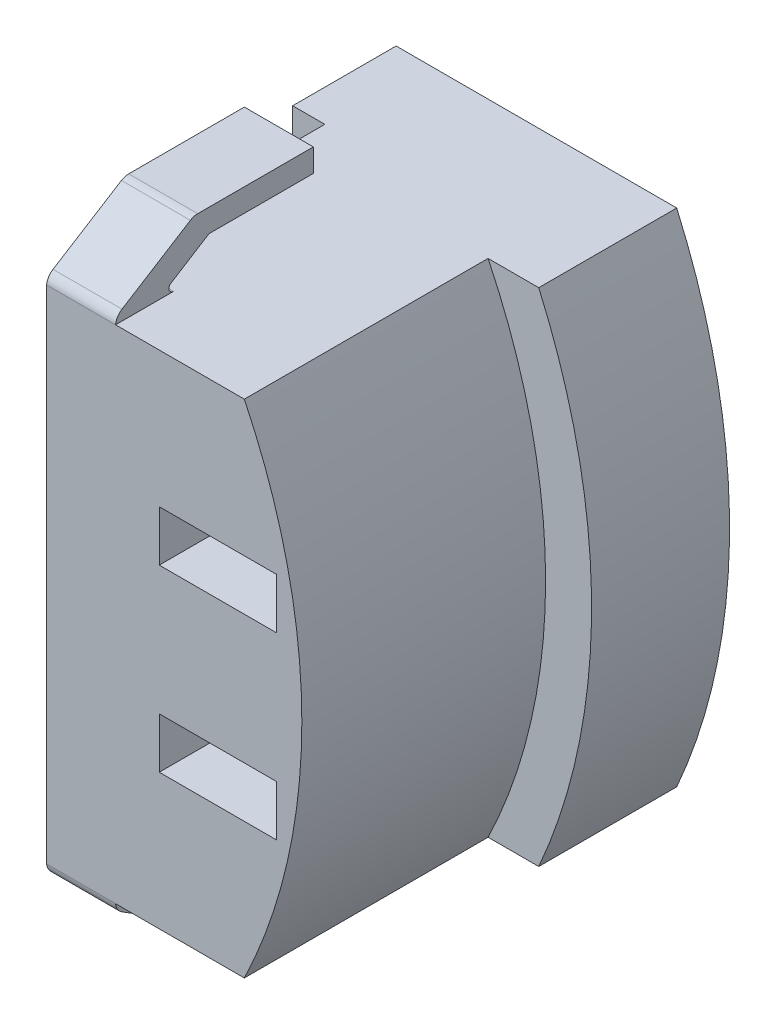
ISO-10303-21;
HEADER;
FILE_DESCRIPTION(('STEP AP214'),'2;1');
FILE_NAME('part.step','',(''),(''),'','','');
FILE_SCHEMA(('AUTOMOTIVE_DESIGN { 1 0 10303 214 1 1 1 1 }'));
ENDSEC;
DATA;
#1=APPLICATION_CONTEXT('core data for automotive mechanical design processes');
#2=APPLICATION_PROTOCOL_DEFINITION('international standard','automotive_design',2000,#1);
#3=PRODUCT_CONTEXT('',#1,'mechanical');
#4=PRODUCT('Part','Part','',(#3));
#5=PRODUCT_RELATED_PRODUCT_CATEGORY('part','',(#4));
#6=PRODUCT_DEFINITION_FORMATION('','',#4);
#7=PRODUCT_DEFINITION_CONTEXT('part definition',#1,'design');
#8=PRODUCT_DEFINITION('design','',#6,#7);
#9=PRODUCT_DEFINITION_SHAPE('','',#8);
#10=(LENGTH_UNIT() NAMED_UNIT(*) SI_UNIT(.MILLI.,.METRE.));
#11=(NAMED_UNIT(*) PLANE_ANGLE_UNIT() SI_UNIT($,.RADIAN.));
#12=(NAMED_UNIT(*) SI_UNIT($,.STERADIAN.) SOLID_ANGLE_UNIT());
#13=UNCERTAINTY_MEASURE_WITH_UNIT(LENGTH_MEASURE(1.E-05),#10,'distance_accuracy_value','');
#14=(GEOMETRIC_REPRESENTATION_CONTEXT(3) GLOBAL_UNCERTAINTY_ASSIGNED_CONTEXT((#13)) GLOBAL_UNIT_ASSIGNED_CONTEXT((#10,
#11,#12)) REPRESENTATION_CONTEXT('',''));
#15=CARTESIAN_POINT('',(0.,0.,0.));
#16=DIRECTION('',(0.,0.,1.));
#17=DIRECTION('',(1.,0.,0.));
#18=AXIS2_PLACEMENT_3D('',#15,#16,#17);
#19=CARTESIAN_POINT('',(0.,0.,-3.));
#20=DIRECTION('',(0.,0.,-1.));
#21=DIRECTION('',(-1.,0.,0.));
#22=AXIS2_PLACEMENT_3D('',#19,#20,#21);
#23=PLANE('',#22);
#24=DIRECTION('',(0.,1.,0.));
#25=VECTOR('',#24,1.);
#26=CARTESIAN_POINT('',(6.25,5.45,-3.));
#27=LINE('',#26,#25);
#28=CARTESIAN_POINT('',(6.25,-5.45,-3.));
#29=VERTEX_POINT('',#28);
#30=CARTESIAN_POINT('',(6.25,-2.5,-3.));
#31=VERTEX_POINT('',#30);
#32=EDGE_CURVE('E1181',#29,#31,#27,.T.);
#33=ORIENTED_EDGE('',*,*,#32,.T.);
#34=DIRECTION('',(1.,0.,0.));
#35=VECTOR('',#34,1.);
#36=CARTESIAN_POINT('',(0.,-2.5,-3.));
#37=LINE('',#36,#35);
#38=CARTESIAN_POINT('',(6.95,-2.5,-3.));
#39=VERTEX_POINT('',#38);
#40=EDGE_CURVE('E1331',#31,#39,#37,.T.);
#41=ORIENTED_EDGE('',*,*,#40,.T.);
#42=DIRECTION('',(0.,-1.,0.));
#43=VECTOR('',#42,1.);
#44=CARTESIAN_POINT('',(6.95,5.45,-3.));
#45=LINE('',#44,#43);
#46=CARTESIAN_POINT('',(6.95,-4.95,-3.));
#47=VERTEX_POINT('',#46);
#48=EDGE_CURVE('E37',#39,#47,#45,.T.);
#49=ORIENTED_EDGE('',*,*,#48,.T.);
#50=DIRECTION('',(-1.,0.,0.));
#51=VECTOR('',#50,1.);
#52=CARTESIAN_POINT('',(11.9,-4.94999999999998,-3.));
#53=LINE('',#52,#51);
#54=CARTESIAN_POINT('',(11.9,-4.94999999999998,-3.));
#55=VERTEX_POINT('',#54);
#56=EDGE_CURVE('E592',#55,#47,#53,.T.);
#57=ORIENTED_EDGE('',*,*,#56,.F.);
#58=DIRECTION('',(0.,-1.,0.));
#59=VECTOR('',#58,1.);
#60=CARTESIAN_POINT('',(11.9,-4.3043008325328,-3.));
#61=LINE('',#60,#59);
#62=CARTESIAN_POINT('',(11.9,-4.5773900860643,-3.));
#63=VERTEX_POINT('',#62);
#64=EDGE_CURVE('E596',#63,#55,#61,.T.);
#65=ORIENTED_EDGE('',*,*,#64,.F.);
#66=CARTESIAN_POINT('',(0.,0.,-3.));
#67=DIRECTION('',(0.,0.,-1.));
#68=DIRECTION('',(-1.,0.,0.));
#69=AXIS2_PLACEMENT_3D('',#66,#67,#68);
#70=CIRCLE('',#69,12.75);
#71=CARTESIAN_POINT('',(11.9,4.57739008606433,-3.));
#72=VERTEX_POINT('',#71);
#73=EDGE_CURVE('E920',#72,#63,#70,.T.);
#74=ORIENTED_EDGE('',*,*,#73,.F.);
#75=DIRECTION('',(0.,-1.,0.));
#76=VECTOR('',#75,1.);
#77=CARTESIAN_POINT('',(11.9,4.30430083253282,-3.));
#78=LINE('',#77,#76);
#79=CARTESIAN_POINT('',(11.9,4.95,-3.));
#80=VERTEX_POINT('',#79);
#81=EDGE_CURVE('E602',#80,#72,#78,.T.);
#82=ORIENTED_EDGE('',*,*,#81,.F.);
#83=DIRECTION('',(1.,0.,0.));
#84=VECTOR('',#83,1.);
#85=CARTESIAN_POINT('',(11.9,4.95,-3.));
#86=LINE('',#85,#84);
#87=CARTESIAN_POINT('',(6.95,4.95,-3.));
#88=VERTEX_POINT('',#87);
#89=EDGE_CURVE('E606',#88,#80,#86,.T.);
#90=ORIENTED_EDGE('',*,*,#89,.F.);
#91=CARTESIAN_POINT('',(6.95,2.5,-3.));
#92=VERTEX_POINT('',#91);
#93=EDGE_CURVE('E1172',#88,#92,#45,.T.);
#94=ORIENTED_EDGE('',*,*,#93,.T.);
#95=DIRECTION('',(-1.,0.,0.));
#96=VECTOR('',#95,1.);
#97=CARTESIAN_POINT('',(0.,2.5,-3.));
#98=LINE('',#97,#96);
#99=CARTESIAN_POINT('',(6.25,2.5,-3.));
#100=VERTEX_POINT('',#99);
#101=EDGE_CURVE('E1332',#92,#100,#98,.T.);
#102=ORIENTED_EDGE('',*,*,#101,.T.);
#103=CARTESIAN_POINT('',(6.25,5.45,-3.));
#104=VERTEX_POINT('',#103);
#105=EDGE_CURVE('E587',#100,#104,#27,.T.);
#106=ORIENTED_EDGE('',*,*,#105,.T.);
#107=DIRECTION('',(1.,0.,0.));
#108=VECTOR('',#107,1.);
#109=CARTESIAN_POINT('',(6.95,5.45,-3.));
#110=LINE('',#109,#108);
#111=CARTESIAN_POINT('',(12.3510121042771,5.45,-3.));
#112=VERTEX_POINT('',#111);
#113=EDGE_CURVE('E1150',#104,#112,#110,.T.);
#114=ORIENTED_EDGE('',*,*,#113,.T.);
#115=CARTESIAN_POINT('',(0.,0.,-3.));
#116=DIRECTION('',(0.,0.,-1.));
#117=DIRECTION('',(-1.,0.,0.));
#118=AXIS2_PLACEMENT_3D('',#115,#116,#117);
#119=CIRCLE('',#118,13.5);
#120=CARTESIAN_POINT('',(12.3510121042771,-5.45,-3.));
#121=VERTEX_POINT('',#120);
#122=EDGE_CURVE('E1151',#112,#121,#119,.T.);
#123=ORIENTED_EDGE('',*,*,#122,.T.);
#124=DIRECTION('',(-1.,0.,0.));
#125=VECTOR('',#124,1.);
#126=CARTESIAN_POINT('',(6.95,-5.45,-3.));
#127=LINE('',#126,#125);
#128=EDGE_CURVE('E1157',#121,#29,#127,.T.);
#129=ORIENTED_EDGE('',*,*,#128,.T.);
#130=EDGE_LOOP('',(#33,#41,#49,#57,#65,#74,#82,#90,#94,#102,#106,#114,#123,#129));
#131=FACE_BOUND('',#130,.T.);
#132=ADVANCED_FACE('F33',(#131),#23,.T.);
#133=CARTESIAN_POINT('',(6.95,5.45,-13.9224539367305));
#134=DIRECTION('',(-1.,0.,0.));
#135=DIRECTION('',(0.,0.,1.));
#136=AXIS2_PLACEMENT_3D('',#133,#134,#135);
#137=PLANE('',#136);
#138=DIRECTION('',(0.,0.,-1.));
#139=VECTOR('',#138,1.);
#140=CARTESIAN_POINT('',(6.95,-2.5,-13.9224539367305));
#141=LINE('',#140,#139);
#142=CARTESIAN_POINT('',(6.95,-2.5,-2.55));
#143=VERTEX_POINT('',#142);
#144=EDGE_CURVE('E1188',#143,#39,#141,.T.);
#145=ORIENTED_EDGE('',*,*,#144,.F.);
#146=DIRECTION('',(0.,-1.,0.));
#147=VECTOR('',#146,1.);
#148=CARTESIAN_POINT('',(6.95,5.45,-2.55));
#149=LINE('',#148,#147);
#150=CARTESIAN_POINT('',(6.95,2.5,-2.55));
#151=VERTEX_POINT('',#150);
#152=EDGE_CURVE('E582',#151,#143,#149,.T.);
#153=ORIENTED_EDGE('',*,*,#152,.F.);
#154=DIRECTION('',(0.,0.,1.));
#155=VECTOR('',#154,1.);
#156=CARTESIAN_POINT('',(6.95,2.5,-13.9224539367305));
#157=LINE('',#156,#155);
#158=EDGE_CURVE('E581',#92,#151,#157,.T.);
#159=ORIENTED_EDGE('',*,*,#158,.F.);
#160=ORIENTED_EDGE('',*,*,#93,.F.);
#161=DIRECTION('',(0.,0.,1.));
#162=VECTOR('',#161,1.);
#163=CARTESIAN_POINT('',(6.95,4.95,5.3));
#164=LINE('',#163,#162);
#165=CARTESIAN_POINT('',(6.95,4.95,-2.55));
#166=VERTEX_POINT('',#165);
#167=EDGE_CURVE('E609',#88,#166,#164,.T.);
#168=ORIENTED_EDGE('',*,*,#167,.T.);
#169=DIRECTION('',(0.,-1.,0.));
#170=VECTOR('',#169,1.);
#171=CARTESIAN_POINT('',(6.95,5.45,-2.55));
#172=LINE('',#171,#170);
#173=CARTESIAN_POINT('',(6.95,4.6,-2.55));
#174=VERTEX_POINT('',#173);
#175=EDGE_CURVE('E613',#166,#174,#172,.T.);
#176=ORIENTED_EDGE('',*,*,#175,.T.);
#177=DIRECTION('',(0.,0.,-1.));
#178=VECTOR('',#177,1.);
#179=CARTESIAN_POINT('',(6.95,4.6,-1.05));
#180=LINE('',#179,#178);
#181=CARTESIAN_POINT('',(6.95,4.6,-1.05));
#182=VERTEX_POINT('',#181);
#183=EDGE_CURVE('E942',#182,#174,#180,.T.);
#184=ORIENTED_EDGE('',*,*,#183,.F.);
#185=DIRECTION('',(0.,1.,0.));
#186=VECTOR('',#185,1.);
#187=CARTESIAN_POINT('',(6.95,4.6,-1.05));
#188=LINE('',#187,#186);
#189=CARTESIAN_POINT('',(6.95,-4.6,-1.05));
#190=VERTEX_POINT('',#189);
#191=EDGE_CURVE('E930',#190,#182,#188,.T.);
#192=ORIENTED_EDGE('',*,*,#191,.F.);
#193=DIRECTION('',(0.,0.,-1.));
#194=VECTOR('',#193,1.);
#195=CARTESIAN_POINT('',(6.95,-4.6,-1.05));
#196=LINE('',#195,#194);
#197=CARTESIAN_POINT('',(6.95,-4.6,-2.55));
#198=VERTEX_POINT('',#197);
#199=EDGE_CURVE('E943',#190,#198,#196,.T.);
#200=ORIENTED_EDGE('',*,*,#199,.T.);
#201=DIRECTION('',(0.,-1.,0.));
#202=VECTOR('',#201,1.);
#203=CARTESIAN_POINT('',(6.95,5.45,-2.55));
#204=LINE('',#203,#202);
#205=CARTESIAN_POINT('',(6.95,-4.95,-2.55));
#206=VERTEX_POINT('',#205);
#207=EDGE_CURVE('E603',#198,#206,#204,.T.);
#208=ORIENTED_EDGE('',*,*,#207,.T.);
#209=DIRECTION('',(0.,0.,-1.));
#210=VECTOR('',#209,1.);
#211=CARTESIAN_POINT('',(6.95,-4.95,5.3));
#212=LINE('',#211,#210);
#213=EDGE_CURVE('E599',#206,#47,#212,.T.);
#214=ORIENTED_EDGE('',*,*,#213,.T.);
#215=ORIENTED_EDGE('',*,*,#48,.F.);
#216=EDGE_LOOP('',(#145,#153,#159,#160,#168,#176,#184,#192,#200,#208,#214,#215));
#217=FACE_BOUND('',#216,.T.);
#218=ADVANCED_FACE('F1296',(#217),#137,.F.);
#219=CARTESIAN_POINT('',(6.25,5.45,-13.9224539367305));
#220=DIRECTION('',(1.,0.,0.));
#221=DIRECTION('',(0.,1.,0.));
#222=AXIS2_PLACEMENT_3D('',#219,#220,#221);
#223=PLANE('',#222);
#224=DIRECTION('',(0.,0.,1.));
#225=VECTOR('',#224,1.);
#226=CARTESIAN_POINT('',(6.25,-2.5,-13.9224539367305));
#227=LINE('',#226,#225);
#228=CARTESIAN_POINT('',(6.25,-2.5,-2.55));
#229=VERTEX_POINT('',#228);
#230=EDGE_CURVE('E11',#31,#229,#227,.T.);
#231=ORIENTED_EDGE('',*,*,#230,.F.);
#232=ORIENTED_EDGE('',*,*,#32,.F.);
#233=DIRECTION('',(0.,0.,1.));
#234=VECTOR('',#233,1.);
#235=CARTESIAN_POINT('',(6.25,-5.45,-13.9224539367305));
#236=LINE('',#235,#234);
#237=CARTESIAN_POINT('',(6.25,-5.45,-0.75));
#238=VERTEX_POINT('',#237);
#239=EDGE_CURVE('E1170',#29,#238,#236,.T.);
#240=ORIENTED_EDGE('',*,*,#239,.T.);
#241=DIRECTION('',(0.,1.,0.));
#242=VECTOR('',#241,1.);
#243=CARTESIAN_POINT('',(6.25,5.45,-0.75));
#244=LINE('',#243,#242);
#245=CARTESIAN_POINT('',(6.25,5.45,-0.75));
#246=VERTEX_POINT('',#245);
#247=EDGE_CURVE('E1168',#238,#246,#244,.T.);
#248=ORIENTED_EDGE('',*,*,#247,.T.);
#249=DIRECTION('',(0.,0.,1.));
#250=VECTOR('',#249,1.);
#251=CARTESIAN_POINT('',(6.25,5.45,-13.9224539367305));
#252=LINE('',#251,#250);
#253=EDGE_CURVE('E1166',#104,#246,#252,.T.);
#254=ORIENTED_EDGE('',*,*,#253,.F.);
#255=ORIENTED_EDGE('',*,*,#105,.F.);
#256=DIRECTION('',(0.,0.,-1.));
#257=VECTOR('',#256,1.);
#258=CARTESIAN_POINT('',(6.25,2.5,-13.9224539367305));
#259=LINE('',#258,#257);
#260=CARTESIAN_POINT('',(6.25,2.5,-2.55));
#261=VERTEX_POINT('',#260);
#262=EDGE_CURVE('E43',#261,#100,#259,.T.);
#263=ORIENTED_EDGE('',*,*,#262,.F.);
#264=DIRECTION('',(0.,1.,0.));
#265=VECTOR('',#264,1.);
#266=CARTESIAN_POINT('',(6.25,5.45,-2.55));
#267=LINE('',#266,#265);
#268=EDGE_CURVE('E567',#229,#261,#267,.T.);
#269=ORIENTED_EDGE('',*,*,#268,.F.);
#270=EDGE_LOOP('',(#231,#232,#240,#248,#254,#255,#263,#269));
#271=FACE_BOUND('',#270,.T.);
#272=ADVANCED_FACE('F585',(#271),#223,.F.);
#273=CARTESIAN_POINT('',(6.95,5.45,5.3));
#274=DIRECTION('',(0.,-1.,0.));
#275=DIRECTION('',(1.,0.,0.));
#276=AXIS2_PLACEMENT_3D('',#273,#274,#275);
#277=PLANE('',#276);
#278=DIRECTION('',(0.,0.,-1.));
#279=VECTOR('',#278,1.);
#280=CARTESIAN_POINT('',(6.95,5.45,5.3));
#281=LINE('',#280,#279);
#282=CARTESIAN_POINT('',(6.95,5.45,4.03941204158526));
#283=VERTEX_POINT('',#282);
#284=CARTESIAN_POINT('',(6.95,5.45,-0.75));
#285=VERTEX_POINT('',#284);
#286=EDGE_CURVE('E1072',#283,#285,#281,.T.);
#287=ORIENTED_EDGE('',*,*,#286,.F.);
#288=DIRECTION('',(-1.,0.,0.));
#289=VECTOR('',#288,1.);
#290=CARTESIAN_POINT('',(8.45,5.45,4.03941204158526));
#291=LINE('',#290,#289);
#292=CARTESIAN_POINT('',(8.45,5.45,4.03941204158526));
#293=VERTEX_POINT('',#292);
#294=EDGE_CURVE('E1073',#283,#293,#291,.F.);
#295=ORIENTED_EDGE('',*,*,#294,.T.);
#296=DIRECTION('',(0.,0.,-1.));
#297=VECTOR('',#296,1.);
#298=CARTESIAN_POINT('',(8.45,5.45,4.38815348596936));
#299=LINE('',#298,#297);
#300=CARTESIAN_POINT('',(8.45,5.45,5.3));
#301=VERTEX_POINT('',#300);
#302=EDGE_CURVE('E1100',#301,#293,#299,.T.);
#303=ORIENTED_EDGE('',*,*,#302,.F.);
#304=DIRECTION('',(-1.,0.,0.));
#305=VECTOR('',#304,1.);
#306=CARTESIAN_POINT('',(6.95,5.45,5.3));
#307=LINE('',#306,#305);
#308=CARTESIAN_POINT('',(11.2493333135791,5.45,5.3));
#309=VERTEX_POINT('',#308);
#310=EDGE_CURVE('E1097',#309,#301,#307,.T.);
#311=ORIENTED_EDGE('',*,*,#310,.F.);
#312=DIRECTION('',(0.,0.,-1.));
#313=VECTOR('',#312,1.);
#314=CARTESIAN_POINT('',(11.2493333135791,5.45,5.3));
#315=LINE('',#314,#313);
#316=CARTESIAN_POINT('',(11.2493333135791,5.45,0.));
#317=VERTEX_POINT('',#316);
#318=EDGE_CURVE('E1046',#309,#317,#315,.T.);
#319=ORIENTED_EDGE('',*,*,#318,.T.);
#320=DIRECTION('',(1.,0.,0.));
#321=VECTOR('',#320,1.);
#322=CARTESIAN_POINT('',(6.95,5.45,0.));
#323=LINE('',#322,#321);
#324=CARTESIAN_POINT('',(12.3510121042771,5.45,0.));
#325=VERTEX_POINT('',#324);
#326=EDGE_CURVE('E945',#317,#325,#323,.T.);
#327=ORIENTED_EDGE('',*,*,#326,.T.);
#328=DIRECTION('',(0.,0.,1.));
#329=VECTOR('',#328,1.);
#330=CARTESIAN_POINT('',(12.3510121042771,5.45,-3.));
#331=LINE('',#330,#329);
#332=EDGE_CURVE('E967',#112,#325,#331,.T.);
#333=ORIENTED_EDGE('',*,*,#332,.F.);
#334=ORIENTED_EDGE('',*,*,#113,.F.);
#335=ORIENTED_EDGE('',*,*,#253,.T.);
#336=DIRECTION('',(1.,0.,0.));
#337=VECTOR('',#336,1.);
#338=CARTESIAN_POINT('',(6.95,5.45,-0.75));
#339=LINE('',#338,#337);
#340=EDGE_CURVE('E1173',#246,#285,#339,.T.);
#341=ORIENTED_EDGE('',*,*,#340,.T.);
#342=EDGE_LOOP('',(#287,#295,#303,#311,#319,#327,#333,#334,#335,#341));
#343=FACE_BOUND('',#342,.T.);
#344=ADVANCED_FACE('F1130',(#343),#277,.F.);
#345=CARTESIAN_POINT('',(0.,0.,-1.05));
#346=DIRECTION('',(0.,0.,-1.));
#347=DIRECTION('',(-1.,0.,0.));
#348=AXIS2_PLACEMENT_3D('',#345,#346,#347);
#349=PLANE('',#348);
#350=DIRECTION('',(-1.,0.,0.));
#351=VECTOR('',#350,1.);
#352=CARTESIAN_POINT('',(7.7,1.95,-1.05));
#353=LINE('',#352,#351);
#354=CARTESIAN_POINT('',(8.45,1.95,-1.05));
#355=VERTEX_POINT('',#354);
#356=CARTESIAN_POINT('',(7.7,1.95,-1.05));
#357=VERTEX_POINT('',#356);
#358=EDGE_CURVE('E902',#355,#357,#353,.T.);
#359=ORIENTED_EDGE('',*,*,#358,.F.);
#360=DIRECTION('',(0.,1.,0.));
#361=VECTOR('',#360,1.);
#362=CARTESIAN_POINT('',(8.45,1.95,-1.05));
#363=LINE('',#362,#361);
#364=CARTESIAN_POINT('',(8.45,1.35,-1.05));
#365=VERTEX_POINT('',#364);
#366=EDGE_CURVE('E676',#365,#355,#363,.T.);
#367=ORIENTED_EDGE('',*,*,#366,.F.);
#368=DIRECTION('',(-1.,0.,0.));
#369=VECTOR('',#368,1.);
#370=CARTESIAN_POINT('',(8.45,1.35,-1.05));
#371=LINE('',#370,#369);
#372=CARTESIAN_POINT('',(11.05,1.35,-1.05));
#373=VERTEX_POINT('',#372);
#374=EDGE_CURVE('E681',#373,#365,#371,.T.);
#375=ORIENTED_EDGE('',*,*,#374,.F.);
#376=DIRECTION('',(0.,-1.,0.));
#377=VECTOR('',#376,1.);
#378=CARTESIAN_POINT('',(11.05,1.95,-1.05));
#379=LINE('',#378,#377);
#380=CARTESIAN_POINT('',(11.05,1.95,-1.05));
#381=VERTEX_POINT('',#380);
#382=EDGE_CURVE('E708',#381,#373,#379,.T.);
#383=ORIENTED_EDGE('',*,*,#382,.F.);
#384=DIRECTION('',(-1.,0.,0.));
#385=VECTOR('',#384,1.);
#386=CARTESIAN_POINT('',(11.05,1.95,-1.05));
#387=LINE('',#386,#385);
#388=CARTESIAN_POINT('',(11.85,1.95,-1.05));
#389=VERTEX_POINT('',#388);
#390=EDGE_CURVE('E706',#389,#381,#387,.T.);
#391=ORIENTED_EDGE('',*,*,#390,.F.);
#392=DIRECTION('',(0.,-1.,0.));
#393=VECTOR('',#392,1.);
#394=CARTESIAN_POINT('',(11.85,1.95,-1.05));
#395=LINE('',#394,#393);
#396=CARTESIAN_POINT('',(11.85,2.55,-1.05));
#397=VERTEX_POINT('',#396);
#398=EDGE_CURVE('E704',#397,#389,#395,.T.);
#399=ORIENTED_EDGE('',*,*,#398,.F.);
#400=DIRECTION('',(1.,0.,0.));
#401=VECTOR('',#400,1.);
#402=CARTESIAN_POINT('',(10.25,2.55,-1.05));
#403=LINE('',#402,#401);
#404=CARTESIAN_POINT('',(10.25,2.55,-1.05));
#405=VERTEX_POINT('',#404);
#406=EDGE_CURVE('E702',#405,#397,#403,.T.);
#407=ORIENTED_EDGE('',*,*,#406,.F.);
#408=DIRECTION('',(0.,1.,0.));
#409=VECTOR('',#408,1.);
#410=CARTESIAN_POINT('',(10.25,1.95,-1.05));
#411=LINE('',#410,#409);
#412=CARTESIAN_POINT('',(10.25,1.95,-1.05));
#413=VERTEX_POINT('',#412);
#414=EDGE_CURVE('E700',#413,#405,#411,.T.);
#415=ORIENTED_EDGE('',*,*,#414,.F.);
#416=DIRECTION('',(1.,0.,0.));
#417=VECTOR('',#416,1.);
#418=CARTESIAN_POINT('',(8.45,1.95,-1.05));
#419=LINE('',#418,#417);
#420=EDGE_CURVE('E698',#355,#413,#419,.T.);
#421=ORIENTED_EDGE('',*,*,#420,.F.);
#422=DIRECTION('',(0.,-1.,0.));
#423=VECTOR('',#422,1.);
#424=CARTESIAN_POINT('',(8.45,4.55,-1.05));
#425=LINE('',#424,#423);
#426=CARTESIAN_POINT('',(8.45,4.55,-1.05));
#427=VERTEX_POINT('',#426);
#428=EDGE_CURVE('E899',#427,#355,#425,.T.);
#429=ORIENTED_EDGE('',*,*,#428,.F.);
#430=DIRECTION('',(1.,0.,0.));
#431=VECTOR('',#430,1.);
#432=CARTESIAN_POINT('',(7.7,4.55,-1.05));
#433=LINE('',#432,#431);
#434=CARTESIAN_POINT('',(7.7,4.55,-1.05));
#435=VERTEX_POINT('',#434);
#436=EDGE_CURVE('E896',#435,#427,#433,.T.);
#437=ORIENTED_EDGE('',*,*,#436,.F.);
#438=DIRECTION('',(0.,1.,0.));
#439=VECTOR('',#438,1.);
#440=CARTESIAN_POINT('',(7.7,4.55,-1.05));
#441=LINE('',#440,#439);
#442=EDGE_CURVE('E887',#357,#435,#441,.T.);
#443=ORIENTED_EDGE('',*,*,#442,.F.);
#444=EDGE_LOOP('',(#359,#367,#375,#383,#391,#399,#407,#415,#421,#429,#437,#443));
#445=FACE_BOUND('',#444,.T.);
#446=DIRECTION('',(0.,-1.,0.));
#447=VECTOR('',#446,1.);
#448=CARTESIAN_POINT('',(11.1,-4.55,-1.05));
#449=LINE('',#448,#447);
#450=CARTESIAN_POINT('',(11.1,-3.45,-1.05));
#451=VERTEX_POINT('',#450);
#452=CARTESIAN_POINT('',(11.1,-4.55,-1.05));
#453=VERTEX_POINT('',#452);
#454=EDGE_CURVE('E733',#451,#453,#449,.T.);
#455=ORIENTED_EDGE('',*,*,#454,.F.);
#456=DIRECTION('',(1.,0.,0.));
#457=VECTOR('',#456,1.);
#458=CARTESIAN_POINT('',(11.1,-3.45,-1.05));
#459=LINE('',#458,#457);
#460=CARTESIAN_POINT('',(9.35,-3.45,-1.05));
#461=VERTEX_POINT('',#460);
#462=EDGE_CURVE('E741',#461,#451,#459,.T.);
#463=ORIENTED_EDGE('',*,*,#462,.F.);
#464=DIRECTION('',(0.,1.,0.));
#465=VECTOR('',#464,1.);
#466=CARTESIAN_POINT('',(9.35,-4.55,-1.05));
#467=LINE('',#466,#465);
#468=CARTESIAN_POINT('',(9.35,-4.55,-1.05));
#469=VERTEX_POINT('',#468);
#470=EDGE_CURVE('E738',#469,#461,#467,.T.);
#471=ORIENTED_EDGE('',*,*,#470,.F.);
#472=DIRECTION('',(-1.,0.,0.));
#473=VECTOR('',#472,1.);
#474=CARTESIAN_POINT('',(11.1,-4.55,-1.05));
#475=LINE('',#474,#473);
#476=EDGE_CURVE('E735',#453,#469,#475,.T.);
#477=ORIENTED_EDGE('',*,*,#476,.F.);
#478=EDGE_LOOP('',(#455,#463,#471,#477));
#479=FACE_BOUND('',#478,.T.);
#480=DIRECTION('',(0.,-1.,0.));
#481=VECTOR('',#480,1.);
#482=CARTESIAN_POINT('',(11.1,0.55,-1.05));
#483=LINE('',#482,#481);
#484=CARTESIAN_POINT('',(11.1,0.55,-1.05));
#485=VERTEX_POINT('',#484);
#486=CARTESIAN_POINT('',(11.1,-0.550000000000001,-1.05));
#487=VERTEX_POINT('',#486);
#488=EDGE_CURVE('E759',#485,#487,#483,.T.);
#489=ORIENTED_EDGE('',*,*,#488,.F.);
#490=DIRECTION('',(1.,0.,0.));
#491=VECTOR('',#490,1.);
#492=CARTESIAN_POINT('',(11.1,0.55,-1.05));
#493=LINE('',#492,#491);
#494=CARTESIAN_POINT('',(9.35,0.55,-1.05));
#495=VERTEX_POINT('',#494);
#496=EDGE_CURVE('E773',#495,#485,#493,.T.);
#497=ORIENTED_EDGE('',*,*,#496,.F.);
#498=DIRECTION('',(0.,1.,0.));
#499=VECTOR('',#498,1.);
#500=CARTESIAN_POINT('',(9.35,0.55,-1.05));
#501=LINE('',#500,#499);
#502=CARTESIAN_POINT('',(9.35,-0.550000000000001,-1.05));
#503=VERTEX_POINT('',#502);
#504=EDGE_CURVE('E770',#503,#495,#501,.T.);
#505=ORIENTED_EDGE('',*,*,#504,.F.);
#506=DIRECTION('',(-1.,0.,0.));
#507=VECTOR('',#506,1.);
#508=CARTESIAN_POINT('',(11.1,-0.550000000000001,-1.05));
#509=LINE('',#508,#507);
#510=EDGE_CURVE('E767',#487,#503,#509,.T.);
#511=ORIENTED_EDGE('',*,*,#510,.F.);
#512=EDGE_LOOP('',(#489,#497,#505,#511));
#513=FACE_BOUND('',#512,.T.);
#514=DIRECTION('',(0.,-1.,0.));
#515=VECTOR('',#514,1.);
#516=CARTESIAN_POINT('',(11.1,4.55,-1.05));
#517=LINE('',#516,#515);
#518=CARTESIAN_POINT('',(11.1,4.55,-1.05));
#519=VERTEX_POINT('',#518);
#520=CARTESIAN_POINT('',(11.1,3.45,-1.05));
#521=VERTEX_POINT('',#520);
#522=EDGE_CURVE('E791',#519,#521,#517,.T.);
#523=ORIENTED_EDGE('',*,*,#522,.F.);
#524=DIRECTION('',(1.,0.,0.));
#525=VECTOR('',#524,1.);
#526=CARTESIAN_POINT('',(11.1,4.55,-1.05));
#527=LINE('',#526,#525);
#528=CARTESIAN_POINT('',(9.35,4.55,-1.05));
#529=VERTEX_POINT('',#528);
#530=EDGE_CURVE('E805',#529,#519,#527,.T.);
#531=ORIENTED_EDGE('',*,*,#530,.F.);
#532=DIRECTION('',(0.,1.,0.));
#533=VECTOR('',#532,1.);
#534=CARTESIAN_POINT('',(9.35,4.55,-1.05));
#535=LINE('',#534,#533);
#536=CARTESIAN_POINT('',(9.35,3.45,-1.05));
#537=VERTEX_POINT('',#536);
#538=EDGE_CURVE('E802',#537,#529,#535,.T.);
#539=ORIENTED_EDGE('',*,*,#538,.F.);
#540=DIRECTION('',(-1.,0.,0.));
#541=VECTOR('',#540,1.);
#542=CARTESIAN_POINT('',(11.1,3.45,-1.05));
#543=LINE('',#542,#541);
#544=EDGE_CURVE('E799',#521,#537,#543,.T.);
#545=ORIENTED_EDGE('',*,*,#544,.F.);
#546=EDGE_LOOP('',(#523,#531,#539,#545));
#547=FACE_BOUND('',#546,.T.);
#548=DIRECTION('',(0.,1.,0.));
#549=VECTOR('',#548,1.);
#550=CARTESIAN_POINT('',(7.7,-1.95,-1.05));
#551=LINE('',#550,#549);
#552=CARTESIAN_POINT('',(7.7,-4.55,-1.05));
#553=VERTEX_POINT('',#552);
#554=CARTESIAN_POINT('',(7.7,-1.95,-1.05));
#555=VERTEX_POINT('',#554);
#556=EDGE_CURVE('E823',#553,#555,#551,.T.);
#557=ORIENTED_EDGE('',*,*,#556,.F.);
#558=DIRECTION('',(-1.,0.,0.));
#559=VECTOR('',#558,1.);
#560=CARTESIAN_POINT('',(7.7,-4.55,-1.05));
#561=LINE('',#560,#559);
#562=CARTESIAN_POINT('',(8.45,-4.55,-1.05));
#563=VERTEX_POINT('',#562);
#564=EDGE_CURVE('E837',#563,#553,#561,.T.);
#565=ORIENTED_EDGE('',*,*,#564,.F.);
#566=DIRECTION('',(0.,-1.,0.));
#567=VECTOR('',#566,1.);
#568=CARTESIAN_POINT('',(8.45,-1.95,-1.05));
#569=LINE('',#568,#567);
#570=CARTESIAN_POINT('',(8.45,-1.95,-1.05));
#571=VERTEX_POINT('',#570);
#572=EDGE_CURVE('E834',#571,#563,#569,.T.);
#573=ORIENTED_EDGE('',*,*,#572,.F.);
#574=DIRECTION('',(1.,0.,0.));
#575=VECTOR('',#574,1.);
#576=CARTESIAN_POINT('',(7.7,-1.95,-1.05));
#577=LINE('',#576,#575);
#578=EDGE_CURVE('E831',#555,#571,#577,.T.);
#579=ORIENTED_EDGE('',*,*,#578,.F.);
#580=EDGE_LOOP('',(#557,#565,#573,#579));
#581=FACE_BOUND('',#580,.T.);
#582=ORIENTED_EDGE('',*,*,#191,.T.);
#583=DIRECTION('',(1.,0.,0.));
#584=VECTOR('',#583,1.);
#585=CARTESIAN_POINT('',(11.8912783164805,4.6,-1.05));
#586=LINE('',#585,#584);
#587=CARTESIAN_POINT('',(11.8912783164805,4.6,-1.05));
#588=VERTEX_POINT('',#587);
#589=EDGE_CURVE('E933',#182,#588,#586,.T.);
#590=ORIENTED_EDGE('',*,*,#589,.T.);
#591=CARTESIAN_POINT('',(0.,0.,-1.05));
#592=DIRECTION('',(0.,0.,-1.));
#593=DIRECTION('',(-1.,0.,0.));
#594=AXIS2_PLACEMENT_3D('',#591,#592,#593);
#595=CIRCLE('',#594,12.75);
#596=CARTESIAN_POINT('',(11.8912783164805,-4.59999999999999,-1.05));
#597=VERTEX_POINT('',#596);
#598=EDGE_CURVE('E936',#588,#597,#595,.T.);
#599=ORIENTED_EDGE('',*,*,#598,.T.);
#600=DIRECTION('',(-1.,0.,0.));
#601=VECTOR('',#600,1.);
#602=CARTESIAN_POINT('',(11.8912783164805,-4.6,-1.05));
#603=LINE('',#602,#601);
#604=EDGE_CURVE('E939',#597,#190,#603,.T.);
#605=ORIENTED_EDGE('',*,*,#604,.T.);
#606=EDGE_LOOP('',(#582,#590,#599,#605));
#607=FACE_BOUND('',#606,.T.);
#608=DIRECTION('',(-1.,0.,0.));
#609=VECTOR('',#608,1.);
#610=CARTESIAN_POINT('',(7.7,-1.3,-1.05));
#611=LINE('',#610,#609);
#612=CARTESIAN_POINT('',(8.45,-1.3,-1.05));
#613=VERTEX_POINT('',#612);
#614=CARTESIAN_POINT('',(7.7,-1.3,-1.05));
#615=VERTEX_POINT('',#614);
#616=EDGE_CURVE('E869',#613,#615,#611,.T.);
#617=ORIENTED_EDGE('',*,*,#616,.F.);
#618=DIRECTION('',(0.,1.,0.));
#619=VECTOR('',#618,1.);
#620=CARTESIAN_POINT('',(8.45,-1.3,-1.05));
#621=LINE('',#620,#619);
#622=CARTESIAN_POINT('',(8.45,-1.9,-1.05));
#623=VERTEX_POINT('',#622);
#624=EDGE_CURVE('E612',#623,#613,#621,.T.);
#625=ORIENTED_EDGE('',*,*,#624,.F.);
#626=DIRECTION('',(-1.,0.,0.));
#627=VECTOR('',#626,1.);
#628=CARTESIAN_POINT('',(8.45,-1.9,-1.05));
#629=LINE('',#628,#627);
#630=CARTESIAN_POINT('',(10.25,-1.9,-1.05));
#631=VERTEX_POINT('',#630);
#632=EDGE_CURVE('E624',#631,#623,#629,.T.);
#633=ORIENTED_EDGE('',*,*,#632,.F.);
#634=DIRECTION('',(0.,1.,0.));
#635=VECTOR('',#634,1.);
#636=CARTESIAN_POINT('',(10.25,-1.9,-1.05));
#637=LINE('',#636,#635);
#638=CARTESIAN_POINT('',(10.25,-2.5,-1.05));
#639=VERTEX_POINT('',#638);
#640=EDGE_CURVE('E651',#639,#631,#637,.T.);
#641=ORIENTED_EDGE('',*,*,#640,.F.);
#642=DIRECTION('',(-1.,0.,0.));
#643=VECTOR('',#642,1.);
#644=CARTESIAN_POINT('',(10.25,-2.5,-1.05));
#645=LINE('',#644,#643);
#646=CARTESIAN_POINT('',(11.85,-2.5,-1.05));
#647=VERTEX_POINT('',#646);
#648=EDGE_CURVE('E649',#647,#639,#645,.T.);
#649=ORIENTED_EDGE('',*,*,#648,.F.);
#650=DIRECTION('',(0.,-1.,0.));
#651=VECTOR('',#650,1.);
#652=CARTESIAN_POINT('',(11.85,-1.9,-1.05));
#653=LINE('',#652,#651);
#654=CARTESIAN_POINT('',(11.85,-1.9,-1.05));
#655=VERTEX_POINT('',#654);
#656=EDGE_CURVE('E647',#655,#647,#653,.T.);
#657=ORIENTED_EDGE('',*,*,#656,.F.);
#658=DIRECTION('',(1.,0.,0.));
#659=VECTOR('',#658,1.);
#660=CARTESIAN_POINT('',(11.05,-1.9,-1.05));
#661=LINE('',#660,#659);
#662=CARTESIAN_POINT('',(11.05,-1.9,-1.05));
#663=VERTEX_POINT('',#662);
#664=EDGE_CURVE('E645',#663,#655,#661,.T.);
#665=ORIENTED_EDGE('',*,*,#664,.F.);
#666=DIRECTION('',(0.,-1.,0.));
#667=VECTOR('',#666,1.);
#668=CARTESIAN_POINT('',(11.05,-1.3,-1.05));
#669=LINE('',#668,#667);
#670=CARTESIAN_POINT('',(11.05,-1.3,-1.05));
#671=VERTEX_POINT('',#670);
#672=EDGE_CURVE('E643',#671,#663,#669,.T.);
#673=ORIENTED_EDGE('',*,*,#672,.F.);
#674=DIRECTION('',(1.,0.,0.));
#675=VECTOR('',#674,1.);
#676=CARTESIAN_POINT('',(8.45,-1.3,-1.05));
#677=LINE('',#676,#675);
#678=EDGE_CURVE('E641',#613,#671,#677,.T.);
#679=ORIENTED_EDGE('',*,*,#678,.F.);
#680=DIRECTION('',(0.,-1.,0.));
#681=VECTOR('',#680,1.);
#682=CARTESIAN_POINT('',(8.45,1.3,-1.05));
#683=LINE('',#682,#681);
#684=CARTESIAN_POINT('',(8.45,1.3,-1.05));
#685=VERTEX_POINT('',#684);
#686=EDGE_CURVE('E866',#685,#613,#683,.T.);
#687=ORIENTED_EDGE('',*,*,#686,.F.);
#688=DIRECTION('',(1.,0.,0.));
#689=VECTOR('',#688,1.);
#690=CARTESIAN_POINT('',(7.7,1.3,-1.05));
#691=LINE('',#690,#689);
#692=CARTESIAN_POINT('',(7.7,1.3,-1.05));
#693=VERTEX_POINT('',#692);
#694=EDGE_CURVE('E863',#693,#685,#691,.T.);
#695=ORIENTED_EDGE('',*,*,#694,.F.);
#696=DIRECTION('',(0.,1.,0.));
#697=VECTOR('',#696,1.);
#698=CARTESIAN_POINT('',(7.7,1.3,-1.05));
#699=LINE('',#698,#697);
#700=EDGE_CURVE('E855',#615,#693,#699,.T.);
#701=ORIENTED_EDGE('',*,*,#700,.F.);
#702=EDGE_LOOP('',(#617,#625,#633,#641,#649,#657,#665,#673,#679,#687,#695,#701));
#703=FACE_BOUND('',#702,.T.);
#704=ADVANCED_FACE('F1306',(#445,#479,#513,#547,#581,#607,#703),#349,.T.);
#705=CARTESIAN_POINT('',(0.,0.,5.3));
#706=DIRECTION('',(0.,0.,1.));
#707=DIRECTION('',(1.,0.,0.));
#708=AXIS2_PLACEMENT_3D('',#705,#706,#707);
#709=PLANE('',#708);
#710=DIRECTION('',(1.,0.,0.));
#711=VECTOR('',#710,1.);
#712=CARTESIAN_POINT('',(9.4,1.4,5.3));
#713=LINE('',#712,#711);
#714=CARTESIAN_POINT('',(9.4,1.4,5.3));
#715=VERTEX_POINT('',#714);
#716=CARTESIAN_POINT('',(11.95,1.4,5.3));
#717=VERTEX_POINT('',#716);
#718=EDGE_CURVE('E1008',#715,#717,#713,.T.);
#719=ORIENTED_EDGE('',*,*,#718,.F.);
#720=DIRECTION('',(0.,-1.,0.));
#721=VECTOR('',#720,1.);
#722=CARTESIAN_POINT('',(9.4,2.5,5.3));
#723=LINE('',#722,#721);
#724=CARTESIAN_POINT('',(9.4,2.5,5.3));
#725=VERTEX_POINT('',#724);
#726=EDGE_CURVE('E1006',#725,#715,#723,.T.);
#727=ORIENTED_EDGE('',*,*,#726,.F.);
#728=DIRECTION('',(-1.,0.,0.));
#729=VECTOR('',#728,1.);
#730=CARTESIAN_POINT('',(9.4,2.5,5.3));
#731=LINE('',#730,#729);
#732=CARTESIAN_POINT('',(11.95,2.5,5.3));
#733=VERTEX_POINT('',#732);
#734=EDGE_CURVE('E1013',#733,#725,#731,.T.);
#735=ORIENTED_EDGE('',*,*,#734,.F.);
#736=DIRECTION('',(0.,1.,0.));
#737=VECTOR('',#736,1.);
#738=CARTESIAN_POINT('',(11.95,2.5,5.3));
#739=LINE('',#738,#737);
#740=EDGE_CURVE('E1010',#717,#733,#739,.T.);
#741=ORIENTED_EDGE('',*,*,#740,.F.);
#742=EDGE_LOOP('',(#719,#727,#735,#741));
#743=FACE_BOUND('',#742,.T.);
#744=CARTESIAN_POINT('',(0.,0.,5.3));
#745=DIRECTION('',(0.,0.,1.));
#746=DIRECTION('',(1.,0.,0.));
#747=AXIS2_PLACEMENT_3D('',#744,#745,#746);
#748=CIRCLE('',#747,12.5);
#749=CARTESIAN_POINT('',(11.2493333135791,-5.45,5.3));
#750=VERTEX_POINT('',#749);
#751=EDGE_CURVE('E1027',#750,#309,#748,.T.);
#752=ORIENTED_EDGE('',*,*,#751,.T.);
#753=ORIENTED_EDGE('',*,*,#310,.T.);
#754=DIRECTION('',(-1.,0.,0.));
#755=VECTOR('',#754,1.);
#756=CARTESIAN_POINT('',(8.45,5.45,5.3));
#757=LINE('',#756,#755);
#758=CARTESIAN_POINT('',(6.95,5.45,5.3));
#759=VERTEX_POINT('',#758);
#760=EDGE_CURVE('E1114',#301,#759,#757,.T.);
#761=ORIENTED_EDGE('',*,*,#760,.T.);
#762=DIRECTION('',(0.,-1.,0.));
#763=VECTOR('',#762,1.);
#764=CARTESIAN_POINT('',(6.95,5.45,5.3));
#765=LINE('',#764,#763);
#766=CARTESIAN_POINT('',(6.95,-5.45,5.3));
#767=VERTEX_POINT('',#766);
#768=EDGE_CURVE('E1059',#759,#767,#765,.T.);
#769=ORIENTED_EDGE('',*,*,#768,.T.);
#770=DIRECTION('',(1.,0.,0.));
#771=VECTOR('',#770,1.);
#772=CARTESIAN_POINT('',(6.95,-5.45,5.3));
#773=LINE('',#772,#771);
#774=CARTESIAN_POINT('',(8.45,-5.45,5.3));
#775=VERTEX_POINT('',#774);
#776=EDGE_CURVE('E1039',#767,#775,#773,.T.);
#777=ORIENTED_EDGE('',*,*,#776,.T.);
#778=EDGE_CURVE('E1056',#775,#750,#773,.T.);
#779=ORIENTED_EDGE('',*,*,#778,.T.);
#780=EDGE_LOOP('',(#752,#753,#761,#769,#777,#779));
#781=FACE_BOUND('',#780,.T.);
#782=DIRECTION('',(1.,0.,0.));
#783=VECTOR('',#782,1.);
#784=CARTESIAN_POINT('',(9.4,-2.5,5.3));
#785=LINE('',#784,#783);
#786=CARTESIAN_POINT('',(9.4,-2.5,5.3));
#787=VERTEX_POINT('',#786);
#788=CARTESIAN_POINT('',(11.95,-2.5,5.3));
#789=VERTEX_POINT('',#788);
#790=EDGE_CURVE('E978',#787,#789,#785,.T.);
#791=ORIENTED_EDGE('',*,*,#790,.F.);
#792=DIRECTION('',(0.,-1.,0.));
#793=VECTOR('',#792,1.);
#794=CARTESIAN_POINT('',(9.4,-1.4,5.3));
#795=LINE('',#794,#793);
#796=CARTESIAN_POINT('',(9.4,-1.4,5.3));
#797=VERTEX_POINT('',#796);
#798=EDGE_CURVE('E976',#797,#787,#795,.T.);
#799=ORIENTED_EDGE('',*,*,#798,.F.);
#800=DIRECTION('',(-1.,0.,0.));
#801=VECTOR('',#800,1.);
#802=CARTESIAN_POINT('',(9.4,-1.4,5.3));
#803=LINE('',#802,#801);
#804=CARTESIAN_POINT('',(11.95,-1.4,5.3));
#805=VERTEX_POINT('',#804);
#806=EDGE_CURVE('E983',#805,#797,#803,.T.);
#807=ORIENTED_EDGE('',*,*,#806,.F.);
#808=DIRECTION('',(0.,1.,0.));
#809=VECTOR('',#808,1.);
#810=CARTESIAN_POINT('',(11.95,-1.4,5.3));
#811=LINE('',#810,#809);
#812=EDGE_CURVE('E980',#789,#805,#811,.T.);
#813=ORIENTED_EDGE('',*,*,#812,.F.);
#814=EDGE_LOOP('',(#791,#799,#807,#813));
#815=FACE_BOUND('',#814,.T.);
#816=ADVANCED_FACE('F1391',(#743,#781,#815),#709,.T.);
#817=CARTESIAN_POINT('',(0.,0.,5.3));
#818=DIRECTION('',(0.,0.,-1.));
#819=DIRECTION('',(-1.,0.,0.));
#820=AXIS2_PLACEMENT_3D('',#817,#818,#819);
#821=CYLINDRICAL_SURFACE('',#820,12.5);
#822=CARTESIAN_POINT('',(0.,0.,0.));
#823=DIRECTION('',(0.,0.,1.));
#824=DIRECTION('',(1.,0.,0.));
#825=AXIS2_PLACEMENT_3D('',#822,#823,#824);
#826=CIRCLE('',#825,12.5);
#827=CARTESIAN_POINT('',(11.2493333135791,-5.45,0.));
#828=VERTEX_POINT('',#827);
#829=EDGE_CURVE('E1024',#828,#317,#826,.T.);
#830=ORIENTED_EDGE('',*,*,#829,.T.);
#831=ORIENTED_EDGE('',*,*,#318,.F.);
#832=ORIENTED_EDGE('',*,*,#751,.F.);
#833=DIRECTION('',(0.,0.,-1.));
#834=VECTOR('',#833,1.);
#835=CARTESIAN_POINT('',(11.2493333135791,-5.45,5.3));
#836=LINE('',#835,#834);
#837=EDGE_CURVE('E1035',#750,#828,#836,.T.);
#838=ORIENTED_EDGE('',*,*,#837,.T.);
#839=EDGE_LOOP('',(#830,#831,#832,#838));
#840=FACE_BOUND('',#839,.T.);
#841=ADVANCED_FACE('F1136',(#840),#821,.T.);
#842=CARTESIAN_POINT('',(6.95,5.45,5.3));
#843=DIRECTION('',(1.,0.,0.));
#844=DIRECTION('',(0.,1.,0.));
#845=AXIS2_PLACEMENT_3D('',#842,#843,#844);
#846=PLANE('',#845);
#847=ORIENTED_EDGE('',*,*,#286,.T.);
#848=DIRECTION('',(0.,-1.,0.));
#849=VECTOR('',#848,1.);
#850=CARTESIAN_POINT('',(6.95,5.45,-0.75));
#851=LINE('',#850,#849);
#852=CARTESIAN_POINT('',(6.95,-5.45,-0.75));
#853=VERTEX_POINT('',#852);
#854=EDGE_CURVE('E1191',#285,#853,#851,.T.);
#855=ORIENTED_EDGE('',*,*,#854,.T.);
#856=DIRECTION('',(0.,0.,-1.));
#857=VECTOR('',#856,1.);
#858=CARTESIAN_POINT('',(6.95,-5.45,5.3));
#859=LINE('',#858,#857);
#860=CARTESIAN_POINT('',(6.95,-5.45,4.03941204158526));
#861=VERTEX_POINT('',#860);
#862=EDGE_CURVE('E1038',#861,#853,#859,.T.);
#863=ORIENTED_EDGE('',*,*,#862,.F.);
#864=CARTESIAN_POINT('',(6.95,-5.55,4.03941204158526));
#865=DIRECTION('',(1.,0.,0.));
#866=DIRECTION('',(0.,1.,0.));
#867=AXIS2_PLACEMENT_3D('',#864,#865,#866);
#868=CIRCLE('',#867,0.1);
#869=CARTESIAN_POINT('',(6.95,-5.63480480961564,4.09240396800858));
#870=VERTEX_POINT('',#869);
#871=EDGE_CURVE('E1208',#861,#870,#868,.T.);
#872=ORIENTED_EDGE('',*,*,#871,.T.);
#873=DIRECTION('',(0.,-0.5299192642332,-0.848048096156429));
#874=VECTOR('',#873,1.);
#875=CARTESIAN_POINT('',(6.95,-6.15,3.26791931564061));
#876=LINE('',#875,#874);
#877=CARTESIAN_POINT('',(6.95,-6.15,3.26791931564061));
#878=VERTEX_POINT('',#877);
#879=EDGE_CURVE('E1079',#870,#878,#876,.T.);
#880=ORIENTED_EDGE('',*,*,#879,.T.);
#881=DIRECTION('',(0.,0.,-1.));
#882=VECTOR('',#881,1.);
#883=CARTESIAN_POINT('',(6.95,-6.15,1.));
#884=LINE('',#883,#882);
#885=CARTESIAN_POINT('',(6.95,-6.15,1.));
#886=VERTEX_POINT('',#885);
#887=EDGE_CURVE('E1081',#878,#886,#884,.T.);
#888=ORIENTED_EDGE('',*,*,#887,.T.);
#889=DIRECTION('',(0.,-1.,0.));
#890=VECTOR('',#889,1.);
#891=CARTESIAN_POINT('',(6.95,-6.65,1.));
#892=LINE('',#891,#890);
#893=CARTESIAN_POINT('',(6.95,-6.65,1.));
#894=VERTEX_POINT('',#893);
#895=EDGE_CURVE('E1248',#886,#894,#892,.T.);
#896=ORIENTED_EDGE('',*,*,#895,.T.);
#897=DIRECTION('',(0.,0.,1.));
#898=VECTOR('',#897,1.);
#899=CARTESIAN_POINT('',(6.95,-6.65,3.51397638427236));
#900=LINE('',#899,#898);
#901=CARTESIAN_POINT('',(6.95,-6.65,3.51397638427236));
#902=VERTEX_POINT('',#901);
#903=EDGE_CURVE('E1251',#894,#902,#900,.T.);
#904=ORIENTED_EDGE('',*,*,#903,.T.);
#905=CARTESIAN_POINT('',(6.95,-6.35,3.51397638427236));
#906=DIRECTION('',(-1.,0.,0.));
#907=DIRECTION('',(0.,1.,0.));
#908=AXIS2_PLACEMENT_3D('',#905,#906,#907);
#909=CIRCLE('',#908,0.300000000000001);
#910=CARTESIAN_POINT('',(6.95,-6.60441442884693,3.67295216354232));
#911=VERTEX_POINT('',#910);
#912=EDGE_CURVE('E1254',#902,#911,#909,.T.);
#913=ORIENTED_EDGE('',*,*,#912,.T.);
#914=DIRECTION('',(0.,0.529919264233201,0.848048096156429));
#915=VECTOR('',#914,1.);
#916=CARTESIAN_POINT('',(6.95,-5.67493666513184,5.16042752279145));
#917=LINE('',#916,#915);
#918=CARTESIAN_POINT('',(6.95,-5.67493666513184,5.16042752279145));
#919=VERTEX_POINT('',#918);
#920=EDGE_CURVE('E1094',#911,#919,#917,.T.);
#921=ORIENTED_EDGE('',*,*,#920,.T.);
#922=CARTESIAN_POINT('',(6.95,-5.42052223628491,5.00145174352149));
#923=DIRECTION('',(-1.,0.,0.));
#924=DIRECTION('',(0.,1.,0.));
#925=AXIS2_PLACEMENT_3D('',#922,#923,#924);
#926=CIRCLE('',#925,0.3);
#927=EDGE_CURVE('E1082',#919,#767,#926,.T.);
#928=ORIENTED_EDGE('',*,*,#927,.T.);
#929=ORIENTED_EDGE('',*,*,#768,.F.);
#930=CARTESIAN_POINT('',(6.95,5.42052223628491,5.00145174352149));
#931=DIRECTION('',(1.,0.,0.));
#932=DIRECTION('',(0.,-1.,0.));
#933=AXIS2_PLACEMENT_3D('',#930,#931,#932);
#934=CIRCLE('',#933,0.3);
#935=CARTESIAN_POINT('',(6.95,5.67493666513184,5.16042752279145));
#936=VERTEX_POINT('',#935);
#937=EDGE_CURVE('E1184',#936,#759,#934,.T.);
#938=ORIENTED_EDGE('',*,*,#937,.F.);
#939=DIRECTION('',(0.,-0.529919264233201,0.848048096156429));
#940=VECTOR('',#939,1.);
#941=CARTESIAN_POINT('',(6.95,5.67493666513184,5.16042752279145));
#942=LINE('',#941,#940);
#943=CARTESIAN_POINT('',(6.95,6.60441442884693,3.67295216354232));
#944=VERTEX_POINT('',#943);
#945=EDGE_CURVE('E1429',#944,#936,#942,.T.);
#946=ORIENTED_EDGE('',*,*,#945,.F.);
#947=CARTESIAN_POINT('',(6.95,6.35,3.51397638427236));
#948=DIRECTION('',(1.,0.,0.));
#949=DIRECTION('',(0.,-1.,0.));
#950=AXIS2_PLACEMENT_3D('',#947,#948,#949);
#951=CIRCLE('',#950,0.300000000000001);
#952=CARTESIAN_POINT('',(6.95,6.65,3.51397638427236));
#953=VERTEX_POINT('',#952);
#954=EDGE_CURVE('E1431',#953,#944,#951,.T.);
#955=ORIENTED_EDGE('',*,*,#954,.F.);
#956=DIRECTION('',(0.,0.,1.));
#957=VECTOR('',#956,1.);
#958=CARTESIAN_POINT('',(6.95,6.65,3.51397638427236));
#959=LINE('',#958,#957);
#960=CARTESIAN_POINT('',(6.95,6.65,1.));
#961=VERTEX_POINT('',#960);
#962=EDGE_CURVE('E1433',#961,#953,#959,.T.);
#963=ORIENTED_EDGE('',*,*,#962,.F.);
#964=DIRECTION('',(0.,1.,0.));
#965=VECTOR('',#964,1.);
#966=CARTESIAN_POINT('',(6.95,6.65,1.));
#967=LINE('',#966,#965);
#968=CARTESIAN_POINT('',(6.95,6.15,1.));
#969=VERTEX_POINT('',#968);
#970=EDGE_CURVE('E1435',#969,#961,#967,.T.);
#971=ORIENTED_EDGE('',*,*,#970,.F.);
#972=DIRECTION('',(0.,0.,-1.));
#973=VECTOR('',#972,1.);
#974=CARTESIAN_POINT('',(6.95,6.15,1.));
#975=LINE('',#974,#973);
#976=CARTESIAN_POINT('',(6.95,6.15,3.26791931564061));
#977=VERTEX_POINT('',#976);
#978=EDGE_CURVE('E1122',#977,#969,#975,.T.);
#979=ORIENTED_EDGE('',*,*,#978,.F.);
#980=DIRECTION('',(0.,0.5299192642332,-0.848048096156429));
#981=VECTOR('',#980,1.);
#982=CARTESIAN_POINT('',(6.95,6.15,3.26791931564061));
#983=LINE('',#982,#981);
#984=CARTESIAN_POINT('',(6.95,5.63480480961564,4.09240396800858));
#985=VERTEX_POINT('',#984);
#986=EDGE_CURVE('E1111',#985,#977,#983,.T.);
#987=ORIENTED_EDGE('',*,*,#986,.F.);
#988=CARTESIAN_POINT('',(6.95,5.55,4.03941204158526));
#989=DIRECTION('',(1.,0.,0.));
#990=DIRECTION('',(0.,1.,0.));
#991=AXIS2_PLACEMENT_3D('',#988,#989,#990);
#992=CIRCLE('',#991,0.1);
#993=EDGE_CURVE('E1211',#985,#283,#992,.T.);
#994=ORIENTED_EDGE('',*,*,#993,.T.);
#995=EDGE_LOOP('',(#847,#855,#863,#872,#880,#888,#896,#904,#913,#921,#928,#929,#938,#946,#955,
#963,#971,#979,#987,#994));
#996=FACE_BOUND('',#995,.T.);
#997=ADVANCED_FACE('F1201',(#996),#846,.F.);
#998=CARTESIAN_POINT('',(6.95,-5.45,5.3));
#999=DIRECTION('',(0.,1.,0.));
#1000=DIRECTION('',(-1.,0.,0.));
#1001=AXIS2_PLACEMENT_3D('',#998,#999,#1000);
#1002=PLANE('',#1001);
#1003=DIRECTION('',(0.,0.,-1.));
#1004=VECTOR('',#1003,1.);
#1005=CARTESIAN_POINT('',(8.45,-5.45,4.38815348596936));
#1006=LINE('',#1005,#1004);
#1007=CARTESIAN_POINT('',(8.45,-5.45,4.03941204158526));
#1008=VERTEX_POINT('',#1007);
#1009=EDGE_CURVE('E1086',#775,#1008,#1006,.T.);
#1010=ORIENTED_EDGE('',*,*,#1009,.T.);
#1011=DIRECTION('',(-1.,0.,0.));
#1012=VECTOR('',#1011,1.);
#1013=CARTESIAN_POINT('',(6.95,-5.45,4.03941204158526));
#1014=LINE('',#1013,#1012);
#1015=EDGE_CURVE('E1075',#1008,#861,#1014,.T.);
#1016=ORIENTED_EDGE('',*,*,#1015,.T.);
#1017=ORIENTED_EDGE('',*,*,#862,.T.);
#1018=DIRECTION('',(-1.,0.,0.));
#1019=VECTOR('',#1018,1.);
#1020=CARTESIAN_POINT('',(6.95,-5.45,-0.75));
#1021=LINE('',#1020,#1019);
#1022=EDGE_CURVE('E57',#853,#238,#1021,.T.);
#1023=ORIENTED_EDGE('',*,*,#1022,.T.);
#1024=ORIENTED_EDGE('',*,*,#239,.F.);
#1025=ORIENTED_EDGE('',*,*,#128,.F.);
#1026=DIRECTION('',(0.,0.,1.));
#1027=VECTOR('',#1026,1.);
#1028=CARTESIAN_POINT('',(12.3510121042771,-5.45,-3.));
#1029=LINE('',#1028,#1027);
#1030=CARTESIAN_POINT('',(12.3510121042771,-5.45,0.));
#1031=VERTEX_POINT('',#1030);
#1032=EDGE_CURVE('E1149',#121,#1031,#1029,.T.);
#1033=ORIENTED_EDGE('',*,*,#1032,.T.);
#1034=DIRECTION('',(-1.,0.,0.));
#1035=VECTOR('',#1034,1.);
#1036=CARTESIAN_POINT('',(6.95,-5.45,0.));
#1037=LINE('',#1036,#1035);
#1038=EDGE_CURVE('E961',#1031,#828,#1037,.T.);
#1039=ORIENTED_EDGE('',*,*,#1038,.T.);
#1040=ORIENTED_EDGE('',*,*,#837,.F.);
#1041=ORIENTED_EDGE('',*,*,#778,.F.);
#1042=EDGE_LOOP('',(#1010,#1016,#1017,#1023,#1024,#1025,#1033,#1039,#1040,#1041));
#1043=FACE_BOUND('',#1042,.T.);
#1044=ADVANCED_FACE('F1145',(#1043),#1002,.F.);
#1045=CARTESIAN_POINT('',(9.4,2.5,5.3));
#1046=DIRECTION('',(1.,0.,0.));
#1047=DIRECTION('',(0.,0.,-1.));
#1048=AXIS2_PLACEMENT_3D('',#1045,#1046,#1047);
#1049=PLANE('',#1048);
#1050=DIRECTION('',(0.,-1.,0.));
#1051=VECTOR('',#1050,1.);
#1052=CARTESIAN_POINT('',(9.4,2.5,0.));
#1053=LINE('',#1052,#1051);
#1054=CARTESIAN_POINT('',(9.4,2.5,0.));
#1055=VERTEX_POINT('',#1054);
#1056=CARTESIAN_POINT('',(9.4,1.4,0.));
#1057=VERTEX_POINT('',#1056);
#1058=EDGE_CURVE('E994',#1055,#1057,#1053,.T.);
#1059=ORIENTED_EDGE('',*,*,#1058,.F.);
#1060=DIRECTION('',(0.,0.,-1.));
#1061=VECTOR('',#1060,1.);
#1062=CARTESIAN_POINT('',(9.4,2.5,5.3));
#1063=LINE('',#1062,#1061);
#1064=EDGE_CURVE('E1015',#725,#1055,#1063,.T.);
#1065=ORIENTED_EDGE('',*,*,#1064,.F.);
#1066=ORIENTED_EDGE('',*,*,#726,.T.);
#1067=DIRECTION('',(0.,0.,-1.));
#1068=VECTOR('',#1067,1.);
#1069=CARTESIAN_POINT('',(9.4,1.4,5.3));
#1070=LINE('',#1069,#1068);
#1071=EDGE_CURVE('E1021',#715,#1057,#1070,.T.);
#1072=ORIENTED_EDGE('',*,*,#1071,.T.);
#1073=EDGE_LOOP('',(#1059,#1065,#1066,#1072));
#1074=FACE_BOUND('',#1073,.T.);
#1075=ADVANCED_FACE('F1386',(#1074),#1049,.T.);
#1076=CARTESIAN_POINT('',(9.4,1.4,5.3));
#1077=DIRECTION('',(0.,1.,0.));
#1078=DIRECTION('',(0.,0.,1.));
#1079=AXIS2_PLACEMENT_3D('',#1076,#1077,#1078);
#1080=PLANE('',#1079);
#1081=DIRECTION('',(1.,0.,0.));
#1082=VECTOR('',#1081,1.);
#1083=CARTESIAN_POINT('',(9.4,1.4,0.));
#1084=LINE('',#1083,#1082);
#1085=CARTESIAN_POINT('',(11.95,1.4,0.));
#1086=VERTEX_POINT('',#1085);
#1087=EDGE_CURVE('E997',#1057,#1086,#1084,.T.);
#1088=ORIENTED_EDGE('',*,*,#1087,.F.);
#1089=ORIENTED_EDGE('',*,*,#1071,.F.);
#1090=ORIENTED_EDGE('',*,*,#718,.T.);
#1091=DIRECTION('',(0.,0.,-1.));
#1092=VECTOR('',#1091,1.);
#1093=CARTESIAN_POINT('',(11.95,1.4,5.3));
#1094=LINE('',#1093,#1092);
#1095=EDGE_CURVE('E1019',#717,#1086,#1094,.T.);
#1096=ORIENTED_EDGE('',*,*,#1095,.T.);
#1097=EDGE_LOOP('',(#1088,#1089,#1090,#1096));
#1098=FACE_BOUND('',#1097,.T.);
#1099=ADVANCED_FACE('F1382',(#1098),#1080,.T.);
#1100=CARTESIAN_POINT('',(11.95,2.5,5.3));
#1101=DIRECTION('',(-1.,0.,0.));
#1102=DIRECTION('',(0.,0.,1.));
#1103=AXIS2_PLACEMENT_3D('',#1100,#1101,#1102);
#1104=PLANE('',#1103);
#1105=DIRECTION('',(0.,1.,0.));
#1106=VECTOR('',#1105,1.);
#1107=CARTESIAN_POINT('',(11.95,2.5,0.));
#1108=LINE('',#1107,#1106);
#1109=CARTESIAN_POINT('',(11.95,2.5,0.));
#1110=VERTEX_POINT('',#1109);
#1111=EDGE_CURVE('E1000',#1086,#1110,#1108,.T.);
#1112=ORIENTED_EDGE('',*,*,#1111,.F.);
#1113=ORIENTED_EDGE('',*,*,#1095,.F.);
#1114=ORIENTED_EDGE('',*,*,#740,.T.);
#1115=DIRECTION('',(0.,0.,-1.));
#1116=VECTOR('',#1115,1.);
#1117=CARTESIAN_POINT('',(11.95,2.5,5.3));
#1118=LINE('',#1117,#1116);
#1119=EDGE_CURVE('E1017',#733,#1110,#1118,.T.);
#1120=ORIENTED_EDGE('',*,*,#1119,.T.);
#1121=EDGE_LOOP('',(#1112,#1113,#1114,#1120));
#1122=FACE_BOUND('',#1121,.T.);
#1123=ADVANCED_FACE('F1378',(#1122),#1104,.T.);
#1124=CARTESIAN_POINT('',(9.4,2.5,5.3));
#1125=DIRECTION('',(0.,-1.,0.));
#1126=DIRECTION('',(1.,0.,0.));
#1127=AXIS2_PLACEMENT_3D('',#1124,#1125,#1126);
#1128=PLANE('',#1127);
#1129=DIRECTION('',(-1.,0.,0.));
#1130=VECTOR('',#1129,1.);
#1131=CARTESIAN_POINT('',(9.4,2.5,0.));
#1132=LINE('',#1131,#1130);
#1133=EDGE_CURVE('E1003',#1110,#1055,#1132,.T.);
#1134=ORIENTED_EDGE('',*,*,#1133,.F.);
#1135=ORIENTED_EDGE('',*,*,#1119,.F.);
#1136=ORIENTED_EDGE('',*,*,#734,.T.);
#1137=ORIENTED_EDGE('',*,*,#1064,.T.);
#1138=EDGE_LOOP('',(#1134,#1135,#1136,#1137));
#1139=FACE_BOUND('',#1138,.T.);
#1140=ADVANCED_FACE('F1374',(#1139),#1128,.T.);
#1141=CARTESIAN_POINT('',(9.4,-1.4,5.3));
#1142=DIRECTION('',(1.,0.,0.));
#1143=DIRECTION('',(0.,1.,0.));
#1144=AXIS2_PLACEMENT_3D('',#1141,#1142,#1143);
#1145=PLANE('',#1144);
#1146=DIRECTION('',(0.,-1.,0.));
#1147=VECTOR('',#1146,1.);
#1148=CARTESIAN_POINT('',(9.4,-1.4,0.));
#1149=LINE('',#1148,#1147);
#1150=CARTESIAN_POINT('',(9.4,-1.4,0.));
#1151=VERTEX_POINT('',#1150);
#1152=CARTESIAN_POINT('',(9.4,-2.5,0.));
#1153=VERTEX_POINT('',#1152);
#1154=EDGE_CURVE('E963',#1151,#1153,#1149,.T.);
#1155=ORIENTED_EDGE('',*,*,#1154,.F.);
#1156=DIRECTION('',(0.,0.,-1.));
#1157=VECTOR('',#1156,1.);
#1158=CARTESIAN_POINT('',(9.4,-1.4,5.3));
#1159=LINE('',#1158,#1157);
#1160=EDGE_CURVE('E985',#797,#1151,#1159,.T.);
#1161=ORIENTED_EDGE('',*,*,#1160,.F.);
#1162=ORIENTED_EDGE('',*,*,#798,.T.);
#1163=DIRECTION('',(0.,0.,-1.));
#1164=VECTOR('',#1163,1.);
#1165=CARTESIAN_POINT('',(9.4,-2.5,5.3));
#1166=LINE('',#1165,#1164);
#1167=EDGE_CURVE('E991',#787,#1153,#1166,.T.);
#1168=ORIENTED_EDGE('',*,*,#1167,.T.);
#1169=EDGE_LOOP('',(#1155,#1161,#1162,#1168));
#1170=FACE_BOUND('',#1169,.T.);
#1171=ADVANCED_FACE('F1370',(#1170),#1145,.T.);
#1172=CARTESIAN_POINT('',(9.4,-2.5,5.3));
#1173=DIRECTION('',(0.,1.,0.));
#1174=DIRECTION('',(0.,0.,1.));
#1175=AXIS2_PLACEMENT_3D('',#1172,#1173,#1174);
#1176=PLANE('',#1175);
#1177=DIRECTION('',(1.,0.,0.));
#1178=VECTOR('',#1177,1.);
#1179=CARTESIAN_POINT('',(9.4,-2.5,0.));
#1180=LINE('',#1179,#1178);
#1181=CARTESIAN_POINT('',(11.95,-2.5,0.));
#1182=VERTEX_POINT('',#1181);
#1183=EDGE_CURVE('E966',#1153,#1182,#1180,.T.);
#1184=ORIENTED_EDGE('',*,*,#1183,.F.);
#1185=ORIENTED_EDGE('',*,*,#1167,.F.);
#1186=ORIENTED_EDGE('',*,*,#790,.T.);
#1187=DIRECTION('',(0.,0.,-1.));
#1188=VECTOR('',#1187,1.);
#1189=CARTESIAN_POINT('',(11.95,-2.5,5.3));
#1190=LINE('',#1189,#1188);
#1191=EDGE_CURVE('E989',#789,#1182,#1190,.T.);
#1192=ORIENTED_EDGE('',*,*,#1191,.T.);
#1193=EDGE_LOOP('',(#1184,#1185,#1186,#1192));
#1194=FACE_BOUND('',#1193,.T.);
#1195=ADVANCED_FACE('F1366',(#1194),#1176,.T.);
#1196=CARTESIAN_POINT('',(11.95,-1.4,5.3));
#1197=DIRECTION('',(-1.,0.,0.));
#1198=DIRECTION('',(0.,-1.,0.));
#1199=AXIS2_PLACEMENT_3D('',#1196,#1197,#1198);
#1200=PLANE('',#1199);
#1201=DIRECTION('',(0.,1.,0.));
#1202=VECTOR('',#1201,1.);
#1203=CARTESIAN_POINT('',(11.95,-1.4,0.));
#1204=LINE('',#1203,#1202);
#1205=CARTESIAN_POINT('',(11.95,-1.4,0.));
#1206=VERTEX_POINT('',#1205);
#1207=EDGE_CURVE('E970',#1182,#1206,#1204,.T.);
#1208=ORIENTED_EDGE('',*,*,#1207,.F.);
#1209=ORIENTED_EDGE('',*,*,#1191,.F.);
#1210=ORIENTED_EDGE('',*,*,#812,.T.);
#1211=DIRECTION('',(0.,0.,-1.));
#1212=VECTOR('',#1211,1.);
#1213=CARTESIAN_POINT('',(11.95,-1.4,5.3));
#1214=LINE('',#1213,#1212);
#1215=EDGE_CURVE('E987',#805,#1206,#1214,.T.);
#1216=ORIENTED_EDGE('',*,*,#1215,.T.);
#1217=EDGE_LOOP('',(#1208,#1209,#1210,#1216));
#1218=FACE_BOUND('',#1217,.T.);
#1219=ADVANCED_FACE('F1362',(#1218),#1200,.T.);
#1220=CARTESIAN_POINT('',(9.4,-1.4,5.3));
#1221=DIRECTION('',(0.,-1.,0.));
#1222=DIRECTION('',(1.,0.,0.));
#1223=AXIS2_PLACEMENT_3D('',#1220,#1221,#1222);
#1224=PLANE('',#1223);
#1225=DIRECTION('',(-1.,0.,0.));
#1226=VECTOR('',#1225,1.);
#1227=CARTESIAN_POINT('',(9.4,-1.4,0.));
#1228=LINE('',#1227,#1226);
#1229=EDGE_CURVE('E973',#1206,#1151,#1228,.T.);
#1230=ORIENTED_EDGE('',*,*,#1229,.F.);
#1231=ORIENTED_EDGE('',*,*,#1215,.F.);
#1232=ORIENTED_EDGE('',*,*,#806,.T.);
#1233=ORIENTED_EDGE('',*,*,#1160,.T.);
#1234=EDGE_LOOP('',(#1230,#1231,#1232,#1233));
#1235=FACE_BOUND('',#1234,.T.);
#1236=ADVANCED_FACE('F1358',(#1235),#1224,.T.);
#1237=CARTESIAN_POINT('',(0.,0.,0.));
#1238=DIRECTION('',(0.,0.,-1.));
#1239=DIRECTION('',(-1.,0.,0.));
#1240=AXIS2_PLACEMENT_3D('',#1237,#1238,#1239);
#1241=PLANE('',#1240);
#1242=ORIENTED_EDGE('',*,*,#1229,.T.);
#1243=ORIENTED_EDGE('',*,*,#1154,.T.);
#1244=ORIENTED_EDGE('',*,*,#1183,.T.);
#1245=ORIENTED_EDGE('',*,*,#1207,.T.);
#1246=EDGE_LOOP('',(#1242,#1243,#1244,#1245));
#1247=FACE_BOUND('',#1246,.T.);
#1248=ADVANCED_FACE('F1361',(#1247),#1241,.F.);
#1249=ORIENTED_EDGE('',*,*,#829,.F.);
#1250=ORIENTED_EDGE('',*,*,#1038,.F.);
#1251=CARTESIAN_POINT('',(0.,0.,0.));
#1252=DIRECTION('',(0.,0.,-1.));
#1253=DIRECTION('',(-1.,0.,0.));
#1254=AXIS2_PLACEMENT_3D('',#1251,#1252,#1253);
#1255=CIRCLE('',#1254,13.5);
#1256=EDGE_CURVE('E956',#325,#1031,#1255,.T.);
#1257=ORIENTED_EDGE('',*,*,#1256,.F.);
#1258=ORIENTED_EDGE('',*,*,#326,.F.);
#1259=EDGE_LOOP('',(#1249,#1250,#1257,#1258));
#1260=FACE_BOUND('',#1259,.T.);
#1261=ADVANCED_FACE('F1141',(#1260),#1241,.F.);
#1262=CARTESIAN_POINT('',(0.,0.,-3.));
#1263=DIRECTION('',(0.,0.,1.));
#1264=DIRECTION('',(1.,0.,0.));
#1265=AXIS2_PLACEMENT_3D('',#1262,#1263,#1264);
#1266=CYLINDRICAL_SURFACE('',#1265,13.5);
#1267=ORIENTED_EDGE('',*,*,#1256,.T.);
#1268=ORIENTED_EDGE('',*,*,#1032,.F.);
#1269=ORIENTED_EDGE('',*,*,#122,.F.);
#1270=ORIENTED_EDGE('',*,*,#332,.T.);
#1271=EDGE_LOOP('',(#1267,#1268,#1269,#1270));
#1272=FACE_BOUND('',#1271,.T.);
#1273=ADVANCED_FACE('F1154',(#1272),#1266,.T.);
#1274=ORIENTED_EDGE('',*,*,#1133,.T.);
#1275=ORIENTED_EDGE('',*,*,#1058,.T.);
#1276=ORIENTED_EDGE('',*,*,#1087,.T.);
#1277=ORIENTED_EDGE('',*,*,#1111,.T.);
#1278=EDGE_LOOP('',(#1274,#1275,#1276,#1277));
#1279=FACE_BOUND('',#1278,.T.);
#1280=ADVANCED_FACE('F1357',(#1279),#1241,.F.);
#1281=CARTESIAN_POINT('',(11.8912783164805,-4.6,-1.05));
#1282=DIRECTION('',(0.,-1.,0.));
#1283=DIRECTION('',(0.,0.,-1.));
#1284=AXIS2_PLACEMENT_3D('',#1281,#1282,#1283);
#1285=PLANE('',#1284);
#1286=DIRECTION('',(0.,0.,-1.));
#1287=VECTOR('',#1286,1.);
#1288=CARTESIAN_POINT('',(11.8912783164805,-4.59999999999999,-1.05));
#1289=LINE('',#1288,#1287);
#1290=CARTESIAN_POINT('',(11.8912783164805,-4.59999999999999,-2.55));
#1291=VERTEX_POINT('',#1290);
#1292=EDGE_CURVE('E946',#597,#1291,#1289,.T.);
#1293=ORIENTED_EDGE('',*,*,#1292,.T.);
#1294=DIRECTION('',(-1.,0.,0.));
#1295=VECTOR('',#1294,1.);
#1296=CARTESIAN_POINT('',(11.8912783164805,-4.6,-2.55));
#1297=LINE('',#1296,#1295);
#1298=EDGE_CURVE('E1276',#1291,#198,#1297,.T.);
#1299=ORIENTED_EDGE('',*,*,#1298,.T.);
#1300=ORIENTED_EDGE('',*,*,#199,.F.);
#1301=ORIENTED_EDGE('',*,*,#604,.F.);
#1302=EDGE_LOOP('',(#1293,#1299,#1300,#1301));
#1303=FACE_BOUND('',#1302,.T.);
#1304=ADVANCED_FACE('F1312',(#1303),#1285,.F.);
#1305=CARTESIAN_POINT('',(0.,0.,-1.05));
#1306=DIRECTION('',(0.,0.,-1.));
#1307=DIRECTION('',(-1.,0.,0.));
#1308=AXIS2_PLACEMENT_3D('',#1305,#1306,#1307);
#1309=CYLINDRICAL_SURFACE('',#1308,12.75);
#1310=DIRECTION('',(0.,0.,-1.));
#1311=VECTOR('',#1310,1.);
#1312=CARTESIAN_POINT('',(11.9,-4.5773900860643,-1.05));
#1313=LINE('',#1312,#1311);
#1314=CARTESIAN_POINT('',(11.9,-4.5773900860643,-2.55));
#1315=VERTEX_POINT('',#1314);
#1316=EDGE_CURVE('E1049',#63,#1315,#1313,.F.);
#1317=ORIENTED_EDGE('',*,*,#1316,.T.);
#1318=CARTESIAN_POINT('',(0.,0.,-2.55));
#1319=DIRECTION('',(0.,0.,1.));
#1320=DIRECTION('',(1.,0.,0.));
#1321=AXIS2_PLACEMENT_3D('',#1318,#1319,#1320);
#1322=CIRCLE('',#1321,12.75);
#1323=EDGE_CURVE('E1052',#1315,#1291,#1322,.F.);
#1324=ORIENTED_EDGE('',*,*,#1323,.T.);
#1325=ORIENTED_EDGE('',*,*,#1292,.F.);
#1326=ORIENTED_EDGE('',*,*,#598,.F.);
#1327=DIRECTION('',(0.,0.,-1.));
#1328=VECTOR('',#1327,1.);
#1329=CARTESIAN_POINT('',(11.8912783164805,4.6,-1.05));
#1330=LINE('',#1329,#1328);
#1331=CARTESIAN_POINT('',(11.8912783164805,4.6,-2.55));
#1332=VERTEX_POINT('',#1331);
#1333=EDGE_CURVE('E949',#588,#1332,#1330,.T.);
#1334=ORIENTED_EDGE('',*,*,#1333,.T.);
#1335=CARTESIAN_POINT('',(0.,0.,-2.55));
#1336=DIRECTION('',(0.,0.,1.));
#1337=DIRECTION('',(1.,0.,0.));
#1338=AXIS2_PLACEMENT_3D('',#1335,#1336,#1337);
#1339=CIRCLE('',#1338,12.75);
#1340=CARTESIAN_POINT('',(11.9,4.57739008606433,-2.55));
#1341=VERTEX_POINT('',#1340);
#1342=EDGE_CURVE('E1286',#1332,#1341,#1339,.F.);
#1343=ORIENTED_EDGE('',*,*,#1342,.T.);
#1344=DIRECTION('',(0.,0.,-1.));
#1345=VECTOR('',#1344,1.);
#1346=CARTESIAN_POINT('',(11.9,4.57739008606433,-1.05));
#1347=LINE('',#1346,#1345);
#1348=EDGE_CURVE('E1045',#1341,#72,#1347,.T.);
#1349=ORIENTED_EDGE('',*,*,#1348,.T.);
#1350=ORIENTED_EDGE('',*,*,#73,.T.);
#1351=EDGE_LOOP('',(#1317,#1324,#1325,#1326,#1334,#1343,#1349,#1350));
#1352=FACE_BOUND('',#1351,.T.);
#1353=ADVANCED_FACE('F1316',(#1352),#1309,.F.);
#1354=CARTESIAN_POINT('',(11.8912783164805,4.6,-1.05));
#1355=DIRECTION('',(0.,1.,0.));
#1356=DIRECTION('',(-1.,0.,0.));
#1357=AXIS2_PLACEMENT_3D('',#1354,#1355,#1356);
#1358=PLANE('',#1357);
#1359=ORIENTED_EDGE('',*,*,#183,.T.);
#1360=DIRECTION('',(1.,0.,0.));
#1361=VECTOR('',#1360,1.);
#1362=CARTESIAN_POINT('',(11.8912783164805,4.6,-2.55));
#1363=LINE('',#1362,#1361);
#1364=EDGE_CURVE('E1042',#174,#1332,#1363,.T.);
#1365=ORIENTED_EDGE('',*,*,#1364,.T.);
#1366=ORIENTED_EDGE('',*,*,#1333,.F.);
#1367=ORIENTED_EDGE('',*,*,#589,.F.);
#1368=EDGE_LOOP('',(#1359,#1365,#1366,#1367));
#1369=FACE_BOUND('',#1368,.T.);
#1370=ADVANCED_FACE('F1303',(#1369),#1358,.F.);
#1371=CARTESIAN_POINT('',(7.7,4.55,3.95));
#1372=DIRECTION('',(-1.,0.,0.));
#1373=DIRECTION('',(0.,0.,1.));
#1374=AXIS2_PLACEMENT_3D('',#1371,#1372,#1373);
#1375=PLANE('',#1374);
#1376=ORIENTED_EDGE('',*,*,#442,.T.);
#1377=DIRECTION('',(0.,0.,-1.));
#1378=VECTOR('',#1377,1.);
#1379=CARTESIAN_POINT('',(7.7,4.55,3.95));
#1380=LINE('',#1379,#1378);
#1381=CARTESIAN_POINT('',(7.7,4.55,3.95));
#1382=VERTEX_POINT('',#1381);
#1383=EDGE_CURVE('E917',#1382,#435,#1380,.T.);
#1384=ORIENTED_EDGE('',*,*,#1383,.F.);
#1385=DIRECTION('',(0.,1.,0.));
#1386=VECTOR('',#1385,1.);
#1387=CARTESIAN_POINT('',(7.7,4.55,3.95));
#1388=LINE('',#1387,#1386);
#1389=CARTESIAN_POINT('',(7.7,1.95,3.95));
#1390=VERTEX_POINT('',#1389);
#1391=EDGE_CURVE('E905',#1390,#1382,#1388,.T.);
#1392=ORIENTED_EDGE('',*,*,#1391,.F.);
#1393=DIRECTION('',(0.,0.,-1.));
#1394=VECTOR('',#1393,1.);
#1395=CARTESIAN_POINT('',(7.7,1.95,3.95));
#1396=LINE('',#1395,#1394);
#1397=EDGE_CURVE('E918',#1390,#357,#1396,.T.);
#1398=ORIENTED_EDGE('',*,*,#1397,.T.);
#1399=EDGE_LOOP('',(#1376,#1384,#1392,#1398));
#1400=FACE_BOUND('',#1399,.T.);
#1401=ADVANCED_FACE('F1729',(#1400),#1375,.F.);
#1402=CARTESIAN_POINT('',(7.7,1.95,3.95));
#1403=DIRECTION('',(0.,-1.,0.));
#1404=DIRECTION('',(0.,0.,-1.));
#1405=AXIS2_PLACEMENT_3D('',#1402,#1403,#1404);
#1406=PLANE('',#1405);
#1407=ORIENTED_EDGE('',*,*,#358,.T.);
#1408=ORIENTED_EDGE('',*,*,#1397,.F.);
#1409=DIRECTION('',(-1.,0.,0.));
#1410=VECTOR('',#1409,1.);
#1411=CARTESIAN_POINT('',(7.7,1.95,3.95));
#1412=LINE('',#1411,#1410);
#1413=CARTESIAN_POINT('',(8.45,1.95,3.95));
#1414=VERTEX_POINT('',#1413);
#1415=EDGE_CURVE('E914',#1414,#1390,#1412,.T.);
#1416=ORIENTED_EDGE('',*,*,#1415,.F.);
#1417=DIRECTION('',(0.,0.,-1.));
#1418=VECTOR('',#1417,1.);
#1419=CARTESIAN_POINT('',(8.45,1.95,3.95));
#1420=LINE('',#1419,#1418);
#1421=EDGE_CURVE('E921',#1414,#355,#1420,.T.);
#1422=ORIENTED_EDGE('',*,*,#1421,.T.);
#1423=EDGE_LOOP('',(#1407,#1408,#1416,#1422));
#1424=FACE_BOUND('',#1423,.T.);
#1425=ADVANCED_FACE('F1725',(#1424),#1406,.F.);
#1426=CARTESIAN_POINT('',(8.45,4.55,3.95));
#1427=DIRECTION('',(1.,0.,0.));
#1428=DIRECTION('',(0.,0.,-1.));
#1429=AXIS2_PLACEMENT_3D('',#1426,#1427,#1428);
#1430=PLANE('',#1429);
#1431=ORIENTED_EDGE('',*,*,#428,.T.);
#1432=ORIENTED_EDGE('',*,*,#1421,.F.);
#1433=DIRECTION('',(0.,-1.,0.));
#1434=VECTOR('',#1433,1.);
#1435=CARTESIAN_POINT('',(8.45,4.55,3.95));
#1436=LINE('',#1435,#1434);
#1437=CARTESIAN_POINT('',(8.45,4.55,3.95));
#1438=VERTEX_POINT('',#1437);
#1439=EDGE_CURVE('E911',#1438,#1414,#1436,.T.);
#1440=ORIENTED_EDGE('',*,*,#1439,.F.);
#1441=DIRECTION('',(0.,0.,-1.));
#1442=VECTOR('',#1441,1.);
#1443=CARTESIAN_POINT('',(8.45,4.55,3.95));
#1444=LINE('',#1443,#1442);
#1445=EDGE_CURVE('E924',#1438,#427,#1444,.T.);
#1446=ORIENTED_EDGE('',*,*,#1445,.T.);
#1447=EDGE_LOOP('',(#1431,#1432,#1440,#1446));
#1448=FACE_BOUND('',#1447,.T.);
#1449=ADVANCED_FACE('F1728',(#1448),#1430,.F.);
#1450=CARTESIAN_POINT('',(7.7,4.55,3.95));
#1451=DIRECTION('',(0.,1.,0.));
#1452=DIRECTION('',(0.,0.,1.));
#1453=AXIS2_PLACEMENT_3D('',#1450,#1451,#1452);
#1454=PLANE('',#1453);
#1455=ORIENTED_EDGE('',*,*,#436,.T.);
#1456=ORIENTED_EDGE('',*,*,#1445,.F.);
#1457=DIRECTION('',(1.,0.,0.));
#1458=VECTOR('',#1457,1.);
#1459=CARTESIAN_POINT('',(7.7,4.55,3.95));
#1460=LINE('',#1459,#1458);
#1461=EDGE_CURVE('E908',#1382,#1438,#1460,.T.);
#1462=ORIENTED_EDGE('',*,*,#1461,.F.);
#1463=ORIENTED_EDGE('',*,*,#1383,.T.);
#1464=EDGE_LOOP('',(#1455,#1456,#1462,#1463));
#1465=FACE_BOUND('',#1464,.T.);
#1466=ADVANCED_FACE('F1723',(#1465),#1454,.F.);
#1467=CARTESIAN_POINT('',(7.7,1.95,3.95));
#1468=DIRECTION('',(0.,0.,1.));
#1469=DIRECTION('',(1.,0.,0.));
#1470=AXIS2_PLACEMENT_3D('',#1467,#1468,#1469);
#1471=PLANE('',#1470);
#1472=ORIENTED_EDGE('',*,*,#1391,.T.);
#1473=ORIENTED_EDGE('',*,*,#1461,.T.);
#1474=ORIENTED_EDGE('',*,*,#1439,.T.);
#1475=ORIENTED_EDGE('',*,*,#1415,.T.);
#1476=EDGE_LOOP('',(#1472,#1473,#1474,#1475));
#1477=FACE_BOUND('',#1476,.T.);
#1478=ADVANCED_FACE('F1719',(#1477),#1471,.F.);
#1479=CARTESIAN_POINT('',(7.7,1.3,3.95));
#1480=DIRECTION('',(-1.,0.,0.));
#1481=DIRECTION('',(0.,-1.,0.));
#1482=AXIS2_PLACEMENT_3D('',#1479,#1480,#1481);
#1483=PLANE('',#1482);
#1484=ORIENTED_EDGE('',*,*,#700,.T.);
#1485=DIRECTION('',(0.,0.,-1.));
#1486=VECTOR('',#1485,1.);
#1487=CARTESIAN_POINT('',(7.7,1.3,3.95));
#1488=LINE('',#1487,#1486);
#1489=CARTESIAN_POINT('',(7.7,1.3,3.95));
#1490=VERTEX_POINT('',#1489);
#1491=EDGE_CURVE('E884',#1490,#693,#1488,.T.);
#1492=ORIENTED_EDGE('',*,*,#1491,.F.);
#1493=DIRECTION('',(0.,1.,0.));
#1494=VECTOR('',#1493,1.);
#1495=CARTESIAN_POINT('',(7.7,1.3,3.95));
#1496=LINE('',#1495,#1494);
#1497=CARTESIAN_POINT('',(7.7,-1.3,3.95));
#1498=VERTEX_POINT('',#1497);
#1499=EDGE_CURVE('E872',#1498,#1490,#1496,.T.);
#1500=ORIENTED_EDGE('',*,*,#1499,.F.);
#1501=DIRECTION('',(0.,0.,-1.));
#1502=VECTOR('',#1501,1.);
#1503=CARTESIAN_POINT('',(7.7,-1.3,3.95));
#1504=LINE('',#1503,#1502);
#1505=EDGE_CURVE('E885',#1498,#615,#1504,.T.);
#1506=ORIENTED_EDGE('',*,*,#1505,.T.);
#1507=EDGE_LOOP('',(#1484,#1492,#1500,#1506));
#1508=FACE_BOUND('',#1507,.T.);
#1509=ADVANCED_FACE('F1709',(#1508),#1483,.F.);
#1510=CARTESIAN_POINT('',(7.7,-1.3,3.95));
#1511=DIRECTION('',(0.,-1.,0.));
#1512=DIRECTION('',(1.,0.,0.));
#1513=AXIS2_PLACEMENT_3D('',#1510,#1511,#1512);
#1514=PLANE('',#1513);
#1515=ORIENTED_EDGE('',*,*,#616,.T.);
#1516=ORIENTED_EDGE('',*,*,#1505,.F.);
#1517=DIRECTION('',(-1.,0.,0.));
#1518=VECTOR('',#1517,1.);
#1519=CARTESIAN_POINT('',(7.7,-1.3,3.95));
#1520=LINE('',#1519,#1518);
#1521=CARTESIAN_POINT('',(8.45,-1.3,3.95));
#1522=VERTEX_POINT('',#1521);
#1523=EDGE_CURVE('E881',#1522,#1498,#1520,.T.);
#1524=ORIENTED_EDGE('',*,*,#1523,.F.);
#1525=DIRECTION('',(0.,0.,-1.));
#1526=VECTOR('',#1525,1.);
#1527=CARTESIAN_POINT('',(8.45,-1.3,3.95));
#1528=LINE('',#1527,#1526);
#1529=EDGE_CURVE('E888',#1522,#613,#1528,.T.);
#1530=ORIENTED_EDGE('',*,*,#1529,.T.);
#1531=EDGE_LOOP('',(#1515,#1516,#1524,#1530));
#1532=FACE_BOUND('',#1531,.T.);
#1533=ADVANCED_FACE('F1705',(#1532),#1514,.F.);
#1534=CARTESIAN_POINT('',(8.45,1.3,3.95));
#1535=DIRECTION('',(1.,0.,0.));
#1536=DIRECTION('',(0.,0.,-1.));
#1537=AXIS2_PLACEMENT_3D('',#1534,#1535,#1536);
#1538=PLANE('',#1537);
#1539=ORIENTED_EDGE('',*,*,#686,.T.);
#1540=ORIENTED_EDGE('',*,*,#1529,.F.);
#1541=DIRECTION('',(0.,-1.,0.));
#1542=VECTOR('',#1541,1.);
#1543=CARTESIAN_POINT('',(8.45,1.3,3.95));
#1544=LINE('',#1543,#1542);
#1545=CARTESIAN_POINT('',(8.45,1.3,3.95));
#1546=VERTEX_POINT('',#1545);
#1547=EDGE_CURVE('E878',#1546,#1522,#1544,.T.);
#1548=ORIENTED_EDGE('',*,*,#1547,.F.);
#1549=DIRECTION('',(0.,0.,-1.));
#1550=VECTOR('',#1549,1.);
#1551=CARTESIAN_POINT('',(8.45,1.3,3.95));
#1552=LINE('',#1551,#1550);
#1553=EDGE_CURVE('E891',#1546,#685,#1552,.T.);
#1554=ORIENTED_EDGE('',*,*,#1553,.T.);
#1555=EDGE_LOOP('',(#1539,#1540,#1548,#1554));
#1556=FACE_BOUND('',#1555,.T.);
#1557=ADVANCED_FACE('F1708',(#1556),#1538,.F.);
#1558=CARTESIAN_POINT('',(7.7,1.3,3.95));
#1559=DIRECTION('',(0.,1.,0.));
#1560=DIRECTION('',(-1.,0.,0.));
#1561=AXIS2_PLACEMENT_3D('',#1558,#1559,#1560);
#1562=PLANE('',#1561);
#1563=ORIENTED_EDGE('',*,*,#694,.T.);
#1564=ORIENTED_EDGE('',*,*,#1553,.F.);
#1565=DIRECTION('',(1.,0.,0.));
#1566=VECTOR('',#1565,1.);
#1567=CARTESIAN_POINT('',(7.7,1.3,3.95));
#1568=LINE('',#1567,#1566);
#1569=EDGE_CURVE('E875',#1490,#1546,#1568,.T.);
#1570=ORIENTED_EDGE('',*,*,#1569,.F.);
#1571=ORIENTED_EDGE('',*,*,#1491,.T.);
#1572=EDGE_LOOP('',(#1563,#1564,#1570,#1571));
#1573=FACE_BOUND('',#1572,.T.);
#1574=ADVANCED_FACE('F1703',(#1573),#1562,.F.);
#1575=CARTESIAN_POINT('',(7.7,-1.3,3.95));
#1576=DIRECTION('',(0.,0.,1.));
#1577=DIRECTION('',(1.,0.,0.));
#1578=AXIS2_PLACEMENT_3D('',#1575,#1576,#1577);
#1579=PLANE('',#1578);
#1580=ORIENTED_EDGE('',*,*,#1499,.T.);
#1581=ORIENTED_EDGE('',*,*,#1569,.T.);
#1582=ORIENTED_EDGE('',*,*,#1547,.T.);
#1583=ORIENTED_EDGE('',*,*,#1523,.T.);
#1584=EDGE_LOOP('',(#1580,#1581,#1582,#1583));
#1585=FACE_BOUND('',#1584,.T.);
#1586=ADVANCED_FACE('F1699',(#1585),#1579,.F.);
#1587=CARTESIAN_POINT('',(7.7,-1.95,3.95));
#1588=DIRECTION('',(-1.,0.,0.));
#1589=DIRECTION('',(0.,0.,1.));
#1590=AXIS2_PLACEMENT_3D('',#1587,#1588,#1589);
#1591=PLANE('',#1590);
#1592=ORIENTED_EDGE('',*,*,#556,.T.);
#1593=DIRECTION('',(0.,0.,-1.));
#1594=VECTOR('',#1593,1.);
#1595=CARTESIAN_POINT('',(7.7,-1.95,3.95));
#1596=LINE('',#1595,#1594);
#1597=CARTESIAN_POINT('',(7.7,-1.95,3.95));
#1598=VERTEX_POINT('',#1597);
#1599=EDGE_CURVE('E852',#1598,#555,#1596,.T.);
#1600=ORIENTED_EDGE('',*,*,#1599,.F.);
#1601=DIRECTION('',(0.,1.,0.));
#1602=VECTOR('',#1601,1.);
#1603=CARTESIAN_POINT('',(7.7,-1.95,3.95));
#1604=LINE('',#1603,#1602);
#1605=CARTESIAN_POINT('',(7.7,-4.55,3.95));
#1606=VERTEX_POINT('',#1605);
#1607=EDGE_CURVE('E840',#1606,#1598,#1604,.T.);
#1608=ORIENTED_EDGE('',*,*,#1607,.F.);
#1609=DIRECTION('',(0.,0.,-1.));
#1610=VECTOR('',#1609,1.);
#1611=CARTESIAN_POINT('',(7.7,-4.55,3.95));
#1612=LINE('',#1611,#1610);
#1613=EDGE_CURVE('E853',#1606,#553,#1612,.T.);
#1614=ORIENTED_EDGE('',*,*,#1613,.T.);
#1615=EDGE_LOOP('',(#1592,#1600,#1608,#1614));
#1616=FACE_BOUND('',#1615,.T.);
#1617=ADVANCED_FACE('F1689',(#1616),#1591,.F.);
#1618=CARTESIAN_POINT('',(7.7,-4.55,3.95));
#1619=DIRECTION('',(0.,-1.,0.));
#1620=DIRECTION('',(0.,0.,-1.));
#1621=AXIS2_PLACEMENT_3D('',#1618,#1619,#1620);
#1622=PLANE('',#1621);
#1623=ORIENTED_EDGE('',*,*,#564,.T.);
#1624=ORIENTED_EDGE('',*,*,#1613,.F.);
#1625=DIRECTION('',(-1.,0.,0.));
#1626=VECTOR('',#1625,1.);
#1627=CARTESIAN_POINT('',(7.7,-4.55,3.95));
#1628=LINE('',#1627,#1626);
#1629=CARTESIAN_POINT('',(8.45,-4.55,3.95));
#1630=VERTEX_POINT('',#1629);
#1631=EDGE_CURVE('E849',#1630,#1606,#1628,.T.);
#1632=ORIENTED_EDGE('',*,*,#1631,.F.);
#1633=DIRECTION('',(0.,0.,-1.));
#1634=VECTOR('',#1633,1.);
#1635=CARTESIAN_POINT('',(8.45,-4.55,3.95));
#1636=LINE('',#1635,#1634);
#1637=EDGE_CURVE('E856',#1630,#563,#1636,.T.);
#1638=ORIENTED_EDGE('',*,*,#1637,.T.);
#1639=EDGE_LOOP('',(#1623,#1624,#1632,#1638));
#1640=FACE_BOUND('',#1639,.T.);
#1641=ADVANCED_FACE('F1685',(#1640),#1622,.F.);
#1642=CARTESIAN_POINT('',(8.45,-1.95,3.95));
#1643=DIRECTION('',(1.,0.,0.));
#1644=DIRECTION('',(0.,0.,-1.));
#1645=AXIS2_PLACEMENT_3D('',#1642,#1643,#1644);
#1646=PLANE('',#1645);
#1647=ORIENTED_EDGE('',*,*,#572,.T.);
#1648=ORIENTED_EDGE('',*,*,#1637,.F.);
#1649=DIRECTION('',(0.,-1.,0.));
#1650=VECTOR('',#1649,1.);
#1651=CARTESIAN_POINT('',(8.45,-1.95,3.95));
#1652=LINE('',#1651,#1650);
#1653=CARTESIAN_POINT('',(8.45,-1.95,3.95));
#1654=VERTEX_POINT('',#1653);
#1655=EDGE_CURVE('E846',#1654,#1630,#1652,.T.);
#1656=ORIENTED_EDGE('',*,*,#1655,.F.);
#1657=DIRECTION('',(0.,0.,-1.));
#1658=VECTOR('',#1657,1.);
#1659=CARTESIAN_POINT('',(8.45,-1.95,3.95));
#1660=LINE('',#1659,#1658);
#1661=EDGE_CURVE('E858',#1654,#571,#1660,.T.);
#1662=ORIENTED_EDGE('',*,*,#1661,.T.);
#1663=EDGE_LOOP('',(#1647,#1648,#1656,#1662));
#1664=FACE_BOUND('',#1663,.T.);
#1665=ADVANCED_FACE('F1688',(#1664),#1646,.F.);
#1666=CARTESIAN_POINT('',(7.7,-1.95,3.95));
#1667=DIRECTION('',(0.,1.,0.));
#1668=DIRECTION('',(0.,0.,1.));
#1669=AXIS2_PLACEMENT_3D('',#1666,#1667,#1668);
#1670=PLANE('',#1669);
#1671=ORIENTED_EDGE('',*,*,#578,.T.);
#1672=ORIENTED_EDGE('',*,*,#1661,.F.);
#1673=DIRECTION('',(1.,0.,0.));
#1674=VECTOR('',#1673,1.);
#1675=CARTESIAN_POINT('',(7.7,-1.95,3.95));
#1676=LINE('',#1675,#1674);
#1677=EDGE_CURVE('E843',#1598,#1654,#1676,.T.);
#1678=ORIENTED_EDGE('',*,*,#1677,.F.);
#1679=ORIENTED_EDGE('',*,*,#1599,.T.);
#1680=EDGE_LOOP('',(#1671,#1672,#1678,#1679));
#1681=FACE_BOUND('',#1680,.T.);
#1682=ADVANCED_FACE('F1683',(#1681),#1670,.F.);
#1683=CARTESIAN_POINT('',(7.7,-4.55,3.95));
#1684=DIRECTION('',(0.,0.,1.));
#1685=DIRECTION('',(1.,0.,0.));
#1686=AXIS2_PLACEMENT_3D('',#1683,#1684,#1685);
#1687=PLANE('',#1686);
#1688=ORIENTED_EDGE('',*,*,#1607,.T.);
#1689=ORIENTED_EDGE('',*,*,#1677,.T.);
#1690=ORIENTED_EDGE('',*,*,#1655,.T.);
#1691=ORIENTED_EDGE('',*,*,#1631,.T.);
#1692=EDGE_LOOP('',(#1688,#1689,#1690,#1691));
#1693=FACE_BOUND('',#1692,.T.);
#1694=ADVANCED_FACE('F1679',(#1693),#1687,.F.);
#1695=CARTESIAN_POINT('',(11.1,4.55,3.95));
#1696=DIRECTION('',(1.,0.,0.));
#1697=DIRECTION('',(0.,0.,-1.));
#1698=AXIS2_PLACEMENT_3D('',#1695,#1696,#1697);
#1699=PLANE('',#1698);
#1700=ORIENTED_EDGE('',*,*,#522,.T.);
#1701=DIRECTION('',(0.,0.,-1.));
#1702=VECTOR('',#1701,1.);
#1703=CARTESIAN_POINT('',(11.1,3.45,3.95));
#1704=LINE('',#1703,#1702);
#1705=CARTESIAN_POINT('',(11.1,3.45,3.95));
#1706=VERTEX_POINT('',#1705);
#1707=EDGE_CURVE('E820',#1706,#521,#1704,.T.);
#1708=ORIENTED_EDGE('',*,*,#1707,.F.);
#1709=DIRECTION('',(0.,-1.,0.));
#1710=VECTOR('',#1709,1.);
#1711=CARTESIAN_POINT('',(11.1,4.55,3.95));
#1712=LINE('',#1711,#1710);
#1713=CARTESIAN_POINT('',(11.1,4.55,3.95));
#1714=VERTEX_POINT('',#1713);
#1715=EDGE_CURVE('E808',#1714,#1706,#1712,.T.);
#1716=ORIENTED_EDGE('',*,*,#1715,.F.);
#1717=DIRECTION('',(0.,0.,-1.));
#1718=VECTOR('',#1717,1.);
#1719=CARTESIAN_POINT('',(11.1,4.55,3.95));
#1720=LINE('',#1719,#1718);
#1721=EDGE_CURVE('E821',#1714,#519,#1720,.T.);
#1722=ORIENTED_EDGE('',*,*,#1721,.T.);
#1723=EDGE_LOOP('',(#1700,#1708,#1716,#1722));
#1724=FACE_BOUND('',#1723,.T.);
#1725=ADVANCED_FACE('F1669',(#1724),#1699,.F.);
#1726=CARTESIAN_POINT('',(11.1,4.55,3.95));
#1727=DIRECTION('',(0.,1.,0.));
#1728=DIRECTION('',(-1.,0.,0.));
#1729=AXIS2_PLACEMENT_3D('',#1726,#1727,#1728);
#1730=PLANE('',#1729);
#1731=ORIENTED_EDGE('',*,*,#530,.T.);
#1732=ORIENTED_EDGE('',*,*,#1721,.F.);
#1733=DIRECTION('',(1.,0.,0.));
#1734=VECTOR('',#1733,1.);
#1735=CARTESIAN_POINT('',(11.1,4.55,3.95));
#1736=LINE('',#1735,#1734);
#1737=CARTESIAN_POINT('',(9.35,4.55,3.95));
#1738=VERTEX_POINT('',#1737);
#1739=EDGE_CURVE('E817',#1738,#1714,#1736,.T.);
#1740=ORIENTED_EDGE('',*,*,#1739,.F.);
#1741=DIRECTION('',(0.,0.,-1.));
#1742=VECTOR('',#1741,1.);
#1743=CARTESIAN_POINT('',(9.35,4.55,3.95));
#1744=LINE('',#1743,#1742);
#1745=EDGE_CURVE('E824',#1738,#529,#1744,.T.);
#1746=ORIENTED_EDGE('',*,*,#1745,.T.);
#1747=EDGE_LOOP('',(#1731,#1732,#1740,#1746));
#1748=FACE_BOUND('',#1747,.T.);
#1749=ADVANCED_FACE('F1665',(#1748),#1730,.F.);
#1750=CARTESIAN_POINT('',(9.35,4.55,3.95));
#1751=DIRECTION('',(-1.,0.,0.));
#1752=DIRECTION('',(0.,0.,1.));
#1753=AXIS2_PLACEMENT_3D('',#1750,#1751,#1752);
#1754=PLANE('',#1753);
#1755=ORIENTED_EDGE('',*,*,#538,.T.);
#1756=ORIENTED_EDGE('',*,*,#1745,.F.);
#1757=DIRECTION('',(0.,1.,0.));
#1758=VECTOR('',#1757,1.);
#1759=CARTESIAN_POINT('',(9.35,4.55,3.95));
#1760=LINE('',#1759,#1758);
#1761=CARTESIAN_POINT('',(9.35,3.45,3.95));
#1762=VERTEX_POINT('',#1761);
#1763=EDGE_CURVE('E814',#1762,#1738,#1760,.T.);
#1764=ORIENTED_EDGE('',*,*,#1763,.F.);
#1765=DIRECTION('',(0.,0.,-1.));
#1766=VECTOR('',#1765,1.);
#1767=CARTESIAN_POINT('',(9.35,3.45,3.95));
#1768=LINE('',#1767,#1766);
#1769=EDGE_CURVE('E826',#1762,#537,#1768,.T.);
#1770=ORIENTED_EDGE('',*,*,#1769,.T.);
#1771=EDGE_LOOP('',(#1755,#1756,#1764,#1770));
#1772=FACE_BOUND('',#1771,.T.);
#1773=ADVANCED_FACE('F1668',(#1772),#1754,.F.);
#1774=CARTESIAN_POINT('',(11.1,3.45,3.95));
#1775=DIRECTION('',(0.,-1.,0.));
#1776=DIRECTION('',(0.,0.,-1.));
#1777=AXIS2_PLACEMENT_3D('',#1774,#1775,#1776);
#1778=PLANE('',#1777);
#1779=ORIENTED_EDGE('',*,*,#544,.T.);
#1780=ORIENTED_EDGE('',*,*,#1769,.F.);
#1781=DIRECTION('',(-1.,0.,0.));
#1782=VECTOR('',#1781,1.);
#1783=CARTESIAN_POINT('',(11.1,3.45,3.95));
#1784=LINE('',#1783,#1782);
#1785=EDGE_CURVE('E811',#1706,#1762,#1784,.T.);
#1786=ORIENTED_EDGE('',*,*,#1785,.F.);
#1787=ORIENTED_EDGE('',*,*,#1707,.T.);
#1788=EDGE_LOOP('',(#1779,#1780,#1786,#1787));
#1789=FACE_BOUND('',#1788,.T.);
#1790=ADVANCED_FACE('F1663',(#1789),#1778,.F.);
#1791=CARTESIAN_POINT('',(11.1,3.45,3.95));
#1792=DIRECTION('',(0.,0.,-1.));
#1793=DIRECTION('',(-1.,0.,0.));
#1794=AXIS2_PLACEMENT_3D('',#1791,#1792,#1793);
#1795=PLANE('',#1794);
#1796=ORIENTED_EDGE('',*,*,#1715,.T.);
#1797=ORIENTED_EDGE('',*,*,#1785,.T.);
#1798=ORIENTED_EDGE('',*,*,#1763,.T.);
#1799=ORIENTED_EDGE('',*,*,#1739,.T.);
#1800=EDGE_LOOP('',(#1796,#1797,#1798,#1799));
#1801=FACE_BOUND('',#1800,.T.);
#1802=ADVANCED_FACE('F1659',(#1801),#1795,.T.);
#1803=CARTESIAN_POINT('',(11.1,0.55,3.95));
#1804=DIRECTION('',(1.,0.,0.));
#1805=DIRECTION('',(0.,0.,-1.));
#1806=AXIS2_PLACEMENT_3D('',#1803,#1804,#1805);
#1807=PLANE('',#1806);
#1808=ORIENTED_EDGE('',*,*,#488,.T.);
#1809=DIRECTION('',(0.,0.,-1.));
#1810=VECTOR('',#1809,1.);
#1811=CARTESIAN_POINT('',(11.1,-0.550000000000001,3.95));
#1812=LINE('',#1811,#1810);
#1813=CARTESIAN_POINT('',(11.1,-0.550000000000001,3.95));
#1814=VERTEX_POINT('',#1813);
#1815=EDGE_CURVE('E788',#1814,#487,#1812,.T.);
#1816=ORIENTED_EDGE('',*,*,#1815,.F.);
#1817=DIRECTION('',(0.,-1.,0.));
#1818=VECTOR('',#1817,1.);
#1819=CARTESIAN_POINT('',(11.1,0.55,3.95));
#1820=LINE('',#1819,#1818);
#1821=CARTESIAN_POINT('',(11.1,0.55,3.95));
#1822=VERTEX_POINT('',#1821);
#1823=EDGE_CURVE('E776',#1822,#1814,#1820,.T.);
#1824=ORIENTED_EDGE('',*,*,#1823,.F.);
#1825=DIRECTION('',(0.,0.,-1.));
#1826=VECTOR('',#1825,1.);
#1827=CARTESIAN_POINT('',(11.1,0.55,3.95));
#1828=LINE('',#1827,#1826);
#1829=EDGE_CURVE('E789',#1822,#485,#1828,.T.);
#1830=ORIENTED_EDGE('',*,*,#1829,.T.);
#1831=EDGE_LOOP('',(#1808,#1816,#1824,#1830));
#1832=FACE_BOUND('',#1831,.T.);
#1833=ADVANCED_FACE('F1649',(#1832),#1807,.F.);
#1834=CARTESIAN_POINT('',(11.1,0.55,3.95));
#1835=DIRECTION('',(0.,1.,0.));
#1836=DIRECTION('',(-1.,0.,0.));
#1837=AXIS2_PLACEMENT_3D('',#1834,#1835,#1836);
#1838=PLANE('',#1837);
#1839=ORIENTED_EDGE('',*,*,#496,.T.);
#1840=ORIENTED_EDGE('',*,*,#1829,.F.);
#1841=DIRECTION('',(1.,0.,0.));
#1842=VECTOR('',#1841,1.);
#1843=CARTESIAN_POINT('',(11.1,0.55,3.95));
#1844=LINE('',#1843,#1842);
#1845=CARTESIAN_POINT('',(9.35,0.55,3.95));
#1846=VERTEX_POINT('',#1845);
#1847=EDGE_CURVE('E785',#1846,#1822,#1844,.T.);
#1848=ORIENTED_EDGE('',*,*,#1847,.F.);
#1849=DIRECTION('',(0.,0.,-1.));
#1850=VECTOR('',#1849,1.);
#1851=CARTESIAN_POINT('',(9.35,0.55,3.95));
#1852=LINE('',#1851,#1850);
#1853=EDGE_CURVE('E792',#1846,#495,#1852,.T.);
#1854=ORIENTED_EDGE('',*,*,#1853,.T.);
#1855=EDGE_LOOP('',(#1839,#1840,#1848,#1854));
#1856=FACE_BOUND('',#1855,.T.);
#1857=ADVANCED_FACE('F1645',(#1856),#1838,.F.);
#1858=CARTESIAN_POINT('',(9.35,0.55,3.95));
#1859=DIRECTION('',(-1.,0.,0.));
#1860=DIRECTION('',(0.,0.,1.));
#1861=AXIS2_PLACEMENT_3D('',#1858,#1859,#1860);
#1862=PLANE('',#1861);
#1863=ORIENTED_EDGE('',*,*,#504,.T.);
#1864=ORIENTED_EDGE('',*,*,#1853,.F.);
#1865=DIRECTION('',(0.,1.,0.));
#1866=VECTOR('',#1865,1.);
#1867=CARTESIAN_POINT('',(9.35,0.55,3.95));
#1868=LINE('',#1867,#1866);
#1869=CARTESIAN_POINT('',(9.35,-0.550000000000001,3.95));
#1870=VERTEX_POINT('',#1869);
#1871=EDGE_CURVE('E782',#1870,#1846,#1868,.T.);
#1872=ORIENTED_EDGE('',*,*,#1871,.F.);
#1873=DIRECTION('',(0.,0.,-1.));
#1874=VECTOR('',#1873,1.);
#1875=CARTESIAN_POINT('',(9.35,-0.550000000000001,3.95));
#1876=LINE('',#1875,#1874);
#1877=EDGE_CURVE('E794',#1870,#503,#1876,.T.);
#1878=ORIENTED_EDGE('',*,*,#1877,.T.);
#1879=EDGE_LOOP('',(#1863,#1864,#1872,#1878));
#1880=FACE_BOUND('',#1879,.T.);
#1881=ADVANCED_FACE('F1648',(#1880),#1862,.F.);
#1882=CARTESIAN_POINT('',(11.1,-0.550000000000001,3.95));
#1883=DIRECTION('',(0.,-1.,0.));
#1884=DIRECTION('',(1.,0.,0.));
#1885=AXIS2_PLACEMENT_3D('',#1882,#1883,#1884);
#1886=PLANE('',#1885);
#1887=ORIENTED_EDGE('',*,*,#510,.T.);
#1888=ORIENTED_EDGE('',*,*,#1877,.F.);
#1889=DIRECTION('',(-1.,0.,0.));
#1890=VECTOR('',#1889,1.);
#1891=CARTESIAN_POINT('',(11.1,-0.550000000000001,3.95));
#1892=LINE('',#1891,#1890);
#1893=EDGE_CURVE('E779',#1814,#1870,#1892,.T.);
#1894=ORIENTED_EDGE('',*,*,#1893,.F.);
#1895=ORIENTED_EDGE('',*,*,#1815,.T.);
#1896=EDGE_LOOP('',(#1887,#1888,#1894,#1895));
#1897=FACE_BOUND('',#1896,.T.);
#1898=ADVANCED_FACE('F1643',(#1897),#1886,.F.);
#1899=CARTESIAN_POINT('',(11.1,-0.550000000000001,3.95));
#1900=DIRECTION('',(0.,0.,-1.));
#1901=DIRECTION('',(-1.,0.,0.));
#1902=AXIS2_PLACEMENT_3D('',#1899,#1900,#1901);
#1903=PLANE('',#1902);
#1904=ORIENTED_EDGE('',*,*,#1823,.T.);
#1905=ORIENTED_EDGE('',*,*,#1893,.T.);
#1906=ORIENTED_EDGE('',*,*,#1871,.T.);
#1907=ORIENTED_EDGE('',*,*,#1847,.T.);
#1908=EDGE_LOOP('',(#1904,#1905,#1906,#1907));
#1909=FACE_BOUND('',#1908,.T.);
#1910=ADVANCED_FACE('F1639',(#1909),#1903,.T.);
#1911=CARTESIAN_POINT('',(11.1,-4.55,3.95));
#1912=DIRECTION('',(1.,0.,0.));
#1913=DIRECTION('',(0.,0.,-1.));
#1914=AXIS2_PLACEMENT_3D('',#1911,#1912,#1913);
#1915=PLANE('',#1914);
#1916=ORIENTED_EDGE('',*,*,#454,.T.);
#1917=DIRECTION('',(0.,0.,-1.));
#1918=VECTOR('',#1917,1.);
#1919=CARTESIAN_POINT('',(11.1,-4.55,3.95));
#1920=LINE('',#1919,#1918);
#1921=CARTESIAN_POINT('',(11.1,-4.55,3.95));
#1922=VERTEX_POINT('',#1921);
#1923=EDGE_CURVE('E756',#1922,#453,#1920,.T.);
#1924=ORIENTED_EDGE('',*,*,#1923,.F.);
#1925=DIRECTION('',(0.,-1.,0.));
#1926=VECTOR('',#1925,1.);
#1927=CARTESIAN_POINT('',(11.1,-4.55,3.95));
#1928=LINE('',#1927,#1926);
#1929=CARTESIAN_POINT('',(11.1,-3.45,3.95));
#1930=VERTEX_POINT('',#1929);
#1931=EDGE_CURVE('E744',#1930,#1922,#1928,.T.);
#1932=ORIENTED_EDGE('',*,*,#1931,.F.);
#1933=DIRECTION('',(0.,0.,-1.));
#1934=VECTOR('',#1933,1.);
#1935=CARTESIAN_POINT('',(11.1,-3.45,3.95));
#1936=LINE('',#1935,#1934);
#1937=EDGE_CURVE('E757',#1930,#451,#1936,.T.);
#1938=ORIENTED_EDGE('',*,*,#1937,.T.);
#1939=EDGE_LOOP('',(#1916,#1924,#1932,#1938));
#1940=FACE_BOUND('',#1939,.T.);
#1941=ADVANCED_FACE('F1629',(#1940),#1915,.F.);
#1942=CARTESIAN_POINT('',(11.1,-3.45,3.95));
#1943=DIRECTION('',(0.,1.,0.));
#1944=DIRECTION('',(-1.,0.,0.));
#1945=AXIS2_PLACEMENT_3D('',#1942,#1943,#1944);
#1946=PLANE('',#1945);
#1947=ORIENTED_EDGE('',*,*,#462,.T.);
#1948=ORIENTED_EDGE('',*,*,#1937,.F.);
#1949=DIRECTION('',(1.,0.,0.));
#1950=VECTOR('',#1949,1.);
#1951=CARTESIAN_POINT('',(11.1,-3.45,3.95));
#1952=LINE('',#1951,#1950);
#1953=CARTESIAN_POINT('',(9.35,-3.45,3.95));
#1954=VERTEX_POINT('',#1953);
#1955=EDGE_CURVE('E753',#1954,#1930,#1952,.T.);
#1956=ORIENTED_EDGE('',*,*,#1955,.F.);
#1957=DIRECTION('',(0.,0.,-1.));
#1958=VECTOR('',#1957,1.);
#1959=CARTESIAN_POINT('',(9.35,-3.45,3.95));
#1960=LINE('',#1959,#1958);
#1961=EDGE_CURVE('E760',#1954,#461,#1960,.T.);
#1962=ORIENTED_EDGE('',*,*,#1961,.T.);
#1963=EDGE_LOOP('',(#1947,#1948,#1956,#1962));
#1964=FACE_BOUND('',#1963,.T.);
#1965=ADVANCED_FACE('F1625',(#1964),#1946,.F.);
#1966=CARTESIAN_POINT('',(9.35,-4.55,3.95));
#1967=DIRECTION('',(-1.,0.,0.));
#1968=DIRECTION('',(0.,0.,1.));
#1969=AXIS2_PLACEMENT_3D('',#1966,#1967,#1968);
#1970=PLANE('',#1969);
#1971=ORIENTED_EDGE('',*,*,#470,.T.);
#1972=ORIENTED_EDGE('',*,*,#1961,.F.);
#1973=DIRECTION('',(0.,1.,0.));
#1974=VECTOR('',#1973,1.);
#1975=CARTESIAN_POINT('',(9.35,-4.55,3.95));
#1976=LINE('',#1975,#1974);
#1977=CARTESIAN_POINT('',(9.35,-4.55,3.95));
#1978=VERTEX_POINT('',#1977);
#1979=EDGE_CURVE('E750',#1978,#1954,#1976,.T.);
#1980=ORIENTED_EDGE('',*,*,#1979,.F.);
#1981=DIRECTION('',(0.,0.,-1.));
#1982=VECTOR('',#1981,1.);
#1983=CARTESIAN_POINT('',(9.35,-4.55,3.95));
#1984=LINE('',#1983,#1982);
#1985=EDGE_CURVE('E762',#1978,#469,#1984,.T.);
#1986=ORIENTED_EDGE('',*,*,#1985,.T.);
#1987=EDGE_LOOP('',(#1971,#1972,#1980,#1986));
#1988=FACE_BOUND('',#1987,.T.);
#1989=ADVANCED_FACE('F1628',(#1988),#1970,.F.);
#1990=CARTESIAN_POINT('',(11.1,-4.55,3.95));
#1991=DIRECTION('',(0.,-1.,0.));
#1992=DIRECTION('',(0.,0.,-1.));
#1993=AXIS2_PLACEMENT_3D('',#1990,#1991,#1992);
#1994=PLANE('',#1993);
#1995=ORIENTED_EDGE('',*,*,#476,.T.);
#1996=ORIENTED_EDGE('',*,*,#1985,.F.);
#1997=DIRECTION('',(-1.,0.,0.));
#1998=VECTOR('',#1997,1.);
#1999=CARTESIAN_POINT('',(11.1,-4.55,3.95));
#2000=LINE('',#1999,#1998);
#2001=EDGE_CURVE('E747',#1922,#1978,#2000,.T.);
#2002=ORIENTED_EDGE('',*,*,#2001,.F.);
#2003=ORIENTED_EDGE('',*,*,#1923,.T.);
#2004=EDGE_LOOP('',(#1995,#1996,#2002,#2003));
#2005=FACE_BOUND('',#2004,.T.);
#2006=ADVANCED_FACE('F1623',(#2005),#1994,.F.);
#2007=CARTESIAN_POINT('',(11.1,-4.55,3.95));
#2008=DIRECTION('',(0.,0.,1.));
#2009=DIRECTION('',(1.,0.,0.));
#2010=AXIS2_PLACEMENT_3D('',#2007,#2008,#2009);
#2011=PLANE('',#2010);
#2012=ORIENTED_EDGE('',*,*,#1931,.T.);
#2013=ORIENTED_EDGE('',*,*,#2001,.T.);
#2014=ORIENTED_EDGE('',*,*,#1979,.T.);
#2015=ORIENTED_EDGE('',*,*,#1955,.T.);
#2016=EDGE_LOOP('',(#2012,#2013,#2014,#2015));
#2017=FACE_BOUND('',#2016,.T.);
#2018=ADVANCED_FACE('F1619',(#2017),#2011,.F.);
#2019=CARTESIAN_POINT('',(8.45,1.95,-2.55));
#2020=DIRECTION('',(1.,0.,0.));
#2021=DIRECTION('',(0.,0.,-1.));
#2022=AXIS2_PLACEMENT_3D('',#2019,#2020,#2021);
#2023=PLANE('',#2022);
#2024=ORIENTED_EDGE('',*,*,#366,.T.);
#2025=DIRECTION('',(0.,0.,1.));
#2026=VECTOR('',#2025,1.);
#2027=CARTESIAN_POINT('',(8.45,1.95,-2.55));
#2028=LINE('',#2027,#2026);
#2029=CARTESIAN_POINT('',(8.45,1.95,-2.55));
#2030=VERTEX_POINT('',#2029);
#2031=EDGE_CURVE('E731',#2030,#355,#2028,.T.);
#2032=ORIENTED_EDGE('',*,*,#2031,.F.);
#2033=DIRECTION('',(0.,1.,0.));
#2034=VECTOR('',#2033,1.);
#2035=CARTESIAN_POINT('',(8.45,1.95,-2.55));
#2036=LINE('',#2035,#2034);
#2037=CARTESIAN_POINT('',(8.45,1.35,-2.55));
#2038=VERTEX_POINT('',#2037);
#2039=EDGE_CURVE('E677',#2038,#2030,#2036,.T.);
#2040=ORIENTED_EDGE('',*,*,#2039,.F.);
#2041=DIRECTION('',(0.,0.,1.));
#2042=VECTOR('',#2041,1.);
#2043=CARTESIAN_POINT('',(8.45,1.35,-2.55));
#2044=LINE('',#2043,#2042);
#2045=EDGE_CURVE('E695',#2038,#365,#2044,.T.);
#2046=ORIENTED_EDGE('',*,*,#2045,.T.);
#2047=EDGE_LOOP('',(#2024,#2032,#2040,#2046));
#2048=FACE_BOUND('',#2047,.T.);
#2049=ADVANCED_FACE('F1615',(#2048),#2023,.F.);
#2050=CARTESIAN_POINT('',(8.45,1.95,-2.55));
#2051=DIRECTION('',(0.,-1.,0.));
#2052=DIRECTION('',(1.,0.,0.));
#2053=AXIS2_PLACEMENT_3D('',#2050,#2051,#2052);
#2054=PLANE('',#2053);
#2055=ORIENTED_EDGE('',*,*,#420,.T.);
#2056=DIRECTION('',(0.,0.,1.));
#2057=VECTOR('',#2056,1.);
#2058=CARTESIAN_POINT('',(10.25,1.95,-2.55));
#2059=LINE('',#2058,#2057);
#2060=CARTESIAN_POINT('',(10.25,1.95,-2.55));
#2061=VERTEX_POINT('',#2060);
#2062=EDGE_CURVE('E728',#2061,#413,#2059,.T.);
#2063=ORIENTED_EDGE('',*,*,#2062,.F.);
#2064=DIRECTION('',(1.,0.,0.));
#2065=VECTOR('',#2064,1.);
#2066=CARTESIAN_POINT('',(8.45,1.95,-2.55));
#2067=LINE('',#2066,#2065);
#2068=EDGE_CURVE('E680',#2030,#2061,#2067,.T.);
#2069=ORIENTED_EDGE('',*,*,#2068,.F.);
#2070=ORIENTED_EDGE('',*,*,#2031,.T.);
#2071=EDGE_LOOP('',(#2055,#2063,#2069,#2070));
#2072=FACE_BOUND('',#2071,.T.);
#2073=ADVANCED_FACE('F1611',(#2072),#2054,.F.);
#2074=CARTESIAN_POINT('',(10.25,1.95,-2.55));
#2075=DIRECTION('',(1.,0.,0.));
#2076=DIRECTION('',(0.,0.,-1.));
#2077=AXIS2_PLACEMENT_3D('',#2074,#2075,#2076);
#2078=PLANE('',#2077);
#2079=ORIENTED_EDGE('',*,*,#414,.T.);
#2080=DIRECTION('',(0.,0.,1.));
#2081=VECTOR('',#2080,1.);
#2082=CARTESIAN_POINT('',(10.25,2.55,-2.55));
#2083=LINE('',#2082,#2081);
#2084=CARTESIAN_POINT('',(10.25,2.55,-2.55));
#2085=VERTEX_POINT('',#2084);
#2086=EDGE_CURVE('E725',#2085,#405,#2083,.T.);
#2087=ORIENTED_EDGE('',*,*,#2086,.F.);
#2088=DIRECTION('',(0.,1.,0.));
#2089=VECTOR('',#2088,1.);
#2090=CARTESIAN_POINT('',(10.25,1.95,-2.55));
#2091=LINE('',#2090,#2089);
#2092=EDGE_CURVE('E683',#2061,#2085,#2091,.T.);
#2093=ORIENTED_EDGE('',*,*,#2092,.F.);
#2094=ORIENTED_EDGE('',*,*,#2062,.T.);
#2095=EDGE_LOOP('',(#2079,#2087,#2093,#2094));
#2096=FACE_BOUND('',#2095,.T.);
#2097=ADVANCED_FACE('F1607',(#2096),#2078,.F.);
#2098=CARTESIAN_POINT('',(10.25,2.55,-2.55));
#2099=DIRECTION('',(0.,-1.,0.));
#2100=DIRECTION('',(1.,0.,0.));
#2101=AXIS2_PLACEMENT_3D('',#2098,#2099,#2100);
#2102=PLANE('',#2101);
#2103=ORIENTED_EDGE('',*,*,#406,.T.);
#2104=DIRECTION('',(0.,0.,1.));
#2105=VECTOR('',#2104,1.);
#2106=CARTESIAN_POINT('',(11.85,2.55,-2.55));
#2107=LINE('',#2106,#2105);
#2108=CARTESIAN_POINT('',(11.85,2.55,-2.55));
#2109=VERTEX_POINT('',#2108);
#2110=EDGE_CURVE('E722',#2109,#397,#2107,.T.);
#2111=ORIENTED_EDGE('',*,*,#2110,.F.);
#2112=DIRECTION('',(1.,0.,0.));
#2113=VECTOR('',#2112,1.);
#2114=CARTESIAN_POINT('',(10.25,2.55,-2.55));
#2115=LINE('',#2114,#2113);
#2116=EDGE_CURVE('E685',#2085,#2109,#2115,.T.);
#2117=ORIENTED_EDGE('',*,*,#2116,.F.);
#2118=ORIENTED_EDGE('',*,*,#2086,.T.);
#2119=EDGE_LOOP('',(#2103,#2111,#2117,#2118));
#2120=FACE_BOUND('',#2119,.T.);
#2121=ADVANCED_FACE('F1603',(#2120),#2102,.F.);
#2122=CARTESIAN_POINT('',(11.85,1.95,-2.55));
#2123=DIRECTION('',(-1.,0.,0.));
#2124=DIRECTION('',(0.,0.,1.));
#2125=AXIS2_PLACEMENT_3D('',#2122,#2123,#2124);
#2126=PLANE('',#2125);
#2127=ORIENTED_EDGE('',*,*,#398,.T.);
#2128=DIRECTION('',(0.,0.,1.));
#2129=VECTOR('',#2128,1.);
#2130=CARTESIAN_POINT('',(11.85,1.95,-2.55));
#2131=LINE('',#2130,#2129);
#2132=CARTESIAN_POINT('',(11.85,1.95,-2.55));
#2133=VERTEX_POINT('',#2132);
#2134=EDGE_CURVE('E719',#2133,#389,#2131,.T.);
#2135=ORIENTED_EDGE('',*,*,#2134,.F.);
#2136=DIRECTION('',(0.,-1.,0.));
#2137=VECTOR('',#2136,1.);
#2138=CARTESIAN_POINT('',(11.85,1.95,-2.55));
#2139=LINE('',#2138,#2137);
#2140=EDGE_CURVE('E687',#2109,#2133,#2139,.T.);
#2141=ORIENTED_EDGE('',*,*,#2140,.F.);
#2142=ORIENTED_EDGE('',*,*,#2110,.T.);
#2143=EDGE_LOOP('',(#2127,#2135,#2141,#2142));
#2144=FACE_BOUND('',#2143,.T.);
#2145=ADVANCED_FACE('F1599',(#2144),#2126,.F.);
#2146=CARTESIAN_POINT('',(11.05,1.95,-2.55));
#2147=DIRECTION('',(0.,1.,0.));
#2148=DIRECTION('',(0.,0.,1.));
#2149=AXIS2_PLACEMENT_3D('',#2146,#2147,#2148);
#2150=PLANE('',#2149);
#2151=ORIENTED_EDGE('',*,*,#390,.T.);
#2152=DIRECTION('',(0.,0.,1.));
#2153=VECTOR('',#2152,1.);
#2154=CARTESIAN_POINT('',(11.05,1.95,-2.55));
#2155=LINE('',#2154,#2153);
#2156=CARTESIAN_POINT('',(11.05,1.95,-2.55));
#2157=VERTEX_POINT('',#2156);
#2158=EDGE_CURVE('E716',#2157,#381,#2155,.T.);
#2159=ORIENTED_EDGE('',*,*,#2158,.F.);
#2160=DIRECTION('',(-1.,0.,0.));
#2161=VECTOR('',#2160,1.);
#2162=CARTESIAN_POINT('',(11.05,1.95,-2.55));
#2163=LINE('',#2162,#2161);
#2164=EDGE_CURVE('E689',#2133,#2157,#2163,.T.);
#2165=ORIENTED_EDGE('',*,*,#2164,.F.);
#2166=ORIENTED_EDGE('',*,*,#2134,.T.);
#2167=EDGE_LOOP('',(#2151,#2159,#2165,#2166));
#2168=FACE_BOUND('',#2167,.T.);
#2169=ADVANCED_FACE('F1595',(#2168),#2150,.F.);
#2170=CARTESIAN_POINT('',(11.05,1.95,-2.55));
#2171=DIRECTION('',(-1.,0.,0.));
#2172=DIRECTION('',(0.,0.,1.));
#2173=AXIS2_PLACEMENT_3D('',#2170,#2171,#2172);
#2174=PLANE('',#2173);
#2175=ORIENTED_EDGE('',*,*,#382,.T.);
#2176=DIRECTION('',(0.,0.,1.));
#2177=VECTOR('',#2176,1.);
#2178=CARTESIAN_POINT('',(11.05,1.35,-2.55));
#2179=LINE('',#2178,#2177);
#2180=CARTESIAN_POINT('',(11.05,1.35,-2.55));
#2181=VERTEX_POINT('',#2180);
#2182=EDGE_CURVE('E714',#2181,#373,#2179,.T.);
#2183=ORIENTED_EDGE('',*,*,#2182,.F.);
#2184=DIRECTION('',(0.,-1.,0.));
#2185=VECTOR('',#2184,1.);
#2186=CARTESIAN_POINT('',(11.05,1.95,-2.55));
#2187=LINE('',#2186,#2185);
#2188=EDGE_CURVE('E691',#2157,#2181,#2187,.T.);
#2189=ORIENTED_EDGE('',*,*,#2188,.F.);
#2190=ORIENTED_EDGE('',*,*,#2158,.T.);
#2191=EDGE_LOOP('',(#2175,#2183,#2189,#2190));
#2192=FACE_BOUND('',#2191,.T.);
#2193=ADVANCED_FACE('F1591',(#2192),#2174,.F.);
#2194=CARTESIAN_POINT('',(8.45,1.35,-2.55));
#2195=DIRECTION('',(0.,1.,0.));
#2196=DIRECTION('',(-1.,0.,0.));
#2197=AXIS2_PLACEMENT_3D('',#2194,#2195,#2196);
#2198=PLANE('',#2197);
#2199=ORIENTED_EDGE('',*,*,#374,.T.);
#2200=ORIENTED_EDGE('',*,*,#2045,.F.);
#2201=DIRECTION('',(-1.,0.,0.));
#2202=VECTOR('',#2201,1.);
#2203=CARTESIAN_POINT('',(8.45,1.35,-2.55));
#2204=LINE('',#2203,#2202);
#2205=EDGE_CURVE('E693',#2181,#2038,#2204,.T.);
#2206=ORIENTED_EDGE('',*,*,#2205,.F.);
#2207=ORIENTED_EDGE('',*,*,#2182,.T.);
#2208=EDGE_LOOP('',(#2199,#2200,#2206,#2207));
#2209=FACE_BOUND('',#2208,.T.);
#2210=ADVANCED_FACE('F1587',(#2209),#2198,.F.);
#2211=CARTESIAN_POINT('',(8.45,1.95,-2.55));
#2212=DIRECTION('',(0.,0.,1.));
#2213=DIRECTION('',(1.,0.,0.));
#2214=AXIS2_PLACEMENT_3D('',#2211,#2212,#2213);
#2215=PLANE('',#2214);
#2216=ORIENTED_EDGE('',*,*,#2039,.T.);
#2217=ORIENTED_EDGE('',*,*,#2068,.T.);
#2218=ORIENTED_EDGE('',*,*,#2092,.T.);
#2219=ORIENTED_EDGE('',*,*,#2116,.T.);
#2220=ORIENTED_EDGE('',*,*,#2140,.T.);
#2221=ORIENTED_EDGE('',*,*,#2164,.T.);
#2222=ORIENTED_EDGE('',*,*,#2188,.T.);
#2223=ORIENTED_EDGE('',*,*,#2205,.T.);
#2224=EDGE_LOOP('',(#2216,#2217,#2218,#2219,#2220,#2221,#2222,#2223));
#2225=FACE_BOUND('',#2224,.T.);
#2226=ADVANCED_FACE('F1583',(#2225),#2215,.F.);
#2227=CARTESIAN_POINT('',(8.45,-1.3,-2.55));
#2228=DIRECTION('',(1.,0.,0.));
#2229=DIRECTION('',(0.,0.,-1.));
#2230=AXIS2_PLACEMENT_3D('',#2227,#2228,#2229);
#2231=PLANE('',#2230);
#2232=ORIENTED_EDGE('',*,*,#624,.T.);
#2233=DIRECTION('',(0.,0.,1.));
#2234=VECTOR('',#2233,1.);
#2235=CARTESIAN_POINT('',(8.45,-1.3,-2.55));
#2236=LINE('',#2235,#2234);
#2237=CARTESIAN_POINT('',(8.45,-1.3,-2.55));
#2238=VERTEX_POINT('',#2237);
#2239=EDGE_CURVE('E674',#2238,#613,#2236,.T.);
#2240=ORIENTED_EDGE('',*,*,#2239,.F.);
#2241=DIRECTION('',(0.,1.,0.));
#2242=VECTOR('',#2241,1.);
#2243=CARTESIAN_POINT('',(8.45,-1.3,-2.55));
#2244=LINE('',#2243,#2242);
#2245=CARTESIAN_POINT('',(8.45,-1.9,-2.55));
#2246=VERTEX_POINT('',#2245);
#2247=EDGE_CURVE('E620',#2246,#2238,#2244,.T.);
#2248=ORIENTED_EDGE('',*,*,#2247,.F.);
#2249=DIRECTION('',(0.,0.,1.));
#2250=VECTOR('',#2249,1.);
#2251=CARTESIAN_POINT('',(8.45,-1.9,-2.55));
#2252=LINE('',#2251,#2250);
#2253=EDGE_CURVE('E638',#2246,#623,#2252,.T.);
#2254=ORIENTED_EDGE('',*,*,#2253,.T.);
#2255=EDGE_LOOP('',(#2232,#2240,#2248,#2254));
#2256=FACE_BOUND('',#2255,.T.);
#2257=ADVANCED_FACE('F1579',(#2256),#2231,.F.);
#2258=CARTESIAN_POINT('',(8.45,-1.3,-2.55));
#2259=DIRECTION('',(0.,-1.,0.));
#2260=DIRECTION('',(1.,0.,0.));
#2261=AXIS2_PLACEMENT_3D('',#2258,#2259,#2260);
#2262=PLANE('',#2261);
#2263=ORIENTED_EDGE('',*,*,#678,.T.);
#2264=DIRECTION('',(0.,0.,1.));
#2265=VECTOR('',#2264,1.);
#2266=CARTESIAN_POINT('',(11.05,-1.3,-2.55));
#2267=LINE('',#2266,#2265);
#2268=CARTESIAN_POINT('',(11.05,-1.3,-2.55));
#2269=VERTEX_POINT('',#2268);
#2270=EDGE_CURVE('E671',#2269,#671,#2267,.T.);
#2271=ORIENTED_EDGE('',*,*,#2270,.F.);
#2272=DIRECTION('',(1.,0.,0.));
#2273=VECTOR('',#2272,1.);
#2274=CARTESIAN_POINT('',(8.45,-1.3,-2.55));
#2275=LINE('',#2274,#2273);
#2276=EDGE_CURVE('E623',#2238,#2269,#2275,.T.);
#2277=ORIENTED_EDGE('',*,*,#2276,.F.);
#2278=ORIENTED_EDGE('',*,*,#2239,.T.);
#2279=EDGE_LOOP('',(#2263,#2271,#2277,#2278));
#2280=FACE_BOUND('',#2279,.T.);
#2281=ADVANCED_FACE('F1575',(#2280),#2262,.F.);
#2282=CARTESIAN_POINT('',(11.05,-1.3,-2.55));
#2283=DIRECTION('',(-1.,0.,0.));
#2284=DIRECTION('',(0.,0.,1.));
#2285=AXIS2_PLACEMENT_3D('',#2282,#2283,#2284);
#2286=PLANE('',#2285);
#2287=ORIENTED_EDGE('',*,*,#672,.T.);
#2288=DIRECTION('',(0.,0.,1.));
#2289=VECTOR('',#2288,1.);
#2290=CARTESIAN_POINT('',(11.05,-1.9,-2.55));
#2291=LINE('',#2290,#2289);
#2292=CARTESIAN_POINT('',(11.05,-1.9,-2.55));
#2293=VERTEX_POINT('',#2292);
#2294=EDGE_CURVE('E668',#2293,#663,#2291,.T.);
#2295=ORIENTED_EDGE('',*,*,#2294,.F.);
#2296=DIRECTION('',(0.,-1.,0.));
#2297=VECTOR('',#2296,1.);
#2298=CARTESIAN_POINT('',(11.05,-1.3,-2.55));
#2299=LINE('',#2298,#2297);
#2300=EDGE_CURVE('E626',#2269,#2293,#2299,.T.);
#2301=ORIENTED_EDGE('',*,*,#2300,.F.);
#2302=ORIENTED_EDGE('',*,*,#2270,.T.);
#2303=EDGE_LOOP('',(#2287,#2295,#2301,#2302));
#2304=FACE_BOUND('',#2303,.T.);
#2305=ADVANCED_FACE('F1571',(#2304),#2286,.F.);
#2306=CARTESIAN_POINT('',(11.05,-1.9,-2.55));
#2307=DIRECTION('',(0.,-1.,0.));
#2308=DIRECTION('',(1.,0.,0.));
#2309=AXIS2_PLACEMENT_3D('',#2306,#2307,#2308);
#2310=PLANE('',#2309);
#2311=ORIENTED_EDGE('',*,*,#664,.T.);
#2312=DIRECTION('',(0.,0.,1.));
#2313=VECTOR('',#2312,1.);
#2314=CARTESIAN_POINT('',(11.85,-1.9,-2.55));
#2315=LINE('',#2314,#2313);
#2316=CARTESIAN_POINT('',(11.85,-1.9,-2.55));
#2317=VERTEX_POINT('',#2316);
#2318=EDGE_CURVE('E665',#2317,#655,#2315,.T.);
#2319=ORIENTED_EDGE('',*,*,#2318,.F.);
#2320=DIRECTION('',(1.,0.,0.));
#2321=VECTOR('',#2320,1.);
#2322=CARTESIAN_POINT('',(11.05,-1.9,-2.55));
#2323=LINE('',#2322,#2321);
#2324=EDGE_CURVE('E628',#2293,#2317,#2323,.T.);
#2325=ORIENTED_EDGE('',*,*,#2324,.F.);
#2326=ORIENTED_EDGE('',*,*,#2294,.T.);
#2327=EDGE_LOOP('',(#2311,#2319,#2325,#2326));
#2328=FACE_BOUND('',#2327,.T.);
#2329=ADVANCED_FACE('F1567',(#2328),#2310,.F.);
#2330=CARTESIAN_POINT('',(11.85,-1.9,-2.55));
#2331=DIRECTION('',(-1.,0.,0.));
#2332=DIRECTION('',(0.,0.,1.));
#2333=AXIS2_PLACEMENT_3D('',#2330,#2331,#2332);
#2334=PLANE('',#2333);
#2335=ORIENTED_EDGE('',*,*,#656,.T.);
#2336=DIRECTION('',(0.,0.,1.));
#2337=VECTOR('',#2336,1.);
#2338=CARTESIAN_POINT('',(11.85,-2.5,-2.55));
#2339=LINE('',#2338,#2337);
#2340=CARTESIAN_POINT('',(11.85,-2.5,-2.55));
#2341=VERTEX_POINT('',#2340);
#2342=EDGE_CURVE('E662',#2341,#647,#2339,.T.);
#2343=ORIENTED_EDGE('',*,*,#2342,.F.);
#2344=DIRECTION('',(0.,-1.,0.));
#2345=VECTOR('',#2344,1.);
#2346=CARTESIAN_POINT('',(11.85,-1.9,-2.55));
#2347=LINE('',#2346,#2345);
#2348=EDGE_CURVE('E630',#2317,#2341,#2347,.T.);
#2349=ORIENTED_EDGE('',*,*,#2348,.F.);
#2350=ORIENTED_EDGE('',*,*,#2318,.T.);
#2351=EDGE_LOOP('',(#2335,#2343,#2349,#2350));
#2352=FACE_BOUND('',#2351,.T.);
#2353=ADVANCED_FACE('F1563',(#2352),#2334,.F.);
#2354=CARTESIAN_POINT('',(10.25,-2.5,-2.55));
#2355=DIRECTION('',(0.,1.,0.));
#2356=DIRECTION('',(0.,0.,1.));
#2357=AXIS2_PLACEMENT_3D('',#2354,#2355,#2356);
#2358=PLANE('',#2357);
#2359=ORIENTED_EDGE('',*,*,#648,.T.);
#2360=DIRECTION('',(0.,0.,1.));
#2361=VECTOR('',#2360,1.);
#2362=CARTESIAN_POINT('',(10.25,-2.5,-2.55));
#2363=LINE('',#2362,#2361);
#2364=CARTESIAN_POINT('',(10.25,-2.5,-2.55));
#2365=VERTEX_POINT('',#2364);
#2366=EDGE_CURVE('E659',#2365,#639,#2363,.T.);
#2367=ORIENTED_EDGE('',*,*,#2366,.F.);
#2368=DIRECTION('',(-1.,0.,0.));
#2369=VECTOR('',#2368,1.);
#2370=CARTESIAN_POINT('',(10.25,-2.5,-2.55));
#2371=LINE('',#2370,#2369);
#2372=EDGE_CURVE('E632',#2341,#2365,#2371,.T.);
#2373=ORIENTED_EDGE('',*,*,#2372,.F.);
#2374=ORIENTED_EDGE('',*,*,#2342,.T.);
#2375=EDGE_LOOP('',(#2359,#2367,#2373,#2374));
#2376=FACE_BOUND('',#2375,.T.);
#2377=ADVANCED_FACE('F1559',(#2376),#2358,.F.);
#2378=CARTESIAN_POINT('',(10.25,-1.9,-2.55));
#2379=DIRECTION('',(1.,0.,0.));
#2380=DIRECTION('',(0.,0.,-1.));
#2381=AXIS2_PLACEMENT_3D('',#2378,#2379,#2380);
#2382=PLANE('',#2381);
#2383=ORIENTED_EDGE('',*,*,#640,.T.);
#2384=DIRECTION('',(0.,0.,1.));
#2385=VECTOR('',#2384,1.);
#2386=CARTESIAN_POINT('',(10.25,-1.9,-2.55));
#2387=LINE('',#2386,#2385);
#2388=CARTESIAN_POINT('',(10.25,-1.9,-2.55));
#2389=VERTEX_POINT('',#2388);
#2390=EDGE_CURVE('E657',#2389,#631,#2387,.T.);
#2391=ORIENTED_EDGE('',*,*,#2390,.F.);
#2392=DIRECTION('',(0.,1.,0.));
#2393=VECTOR('',#2392,1.);
#2394=CARTESIAN_POINT('',(10.25,-1.9,-2.55));
#2395=LINE('',#2394,#2393);
#2396=EDGE_CURVE('E634',#2365,#2389,#2395,.T.);
#2397=ORIENTED_EDGE('',*,*,#2396,.F.);
#2398=ORIENTED_EDGE('',*,*,#2366,.T.);
#2399=EDGE_LOOP('',(#2383,#2391,#2397,#2398));
#2400=FACE_BOUND('',#2399,.T.);
#2401=ADVANCED_FACE('F1555',(#2400),#2382,.F.);
#2402=CARTESIAN_POINT('',(8.45,-1.9,-2.55));
#2403=DIRECTION('',(0.,1.,0.));
#2404=DIRECTION('',(-1.,0.,0.));
#2405=AXIS2_PLACEMENT_3D('',#2402,#2403,#2404);
#2406=PLANE('',#2405);
#2407=ORIENTED_EDGE('',*,*,#632,.T.);
#2408=ORIENTED_EDGE('',*,*,#2253,.F.);
#2409=DIRECTION('',(-1.,0.,0.));
#2410=VECTOR('',#2409,1.);
#2411=CARTESIAN_POINT('',(8.45,-1.9,-2.55));
#2412=LINE('',#2411,#2410);
#2413=EDGE_CURVE('E636',#2389,#2246,#2412,.T.);
#2414=ORIENTED_EDGE('',*,*,#2413,.F.);
#2415=ORIENTED_EDGE('',*,*,#2390,.T.);
#2416=EDGE_LOOP('',(#2407,#2408,#2414,#2415));
#2417=FACE_BOUND('',#2416,.T.);
#2418=ADVANCED_FACE('F1551',(#2417),#2406,.F.);
#2419=CARTESIAN_POINT('',(8.45,-2.5,-2.55));
#2420=DIRECTION('',(0.,0.,1.));
#2421=DIRECTION('',(1.,0.,0.));
#2422=AXIS2_PLACEMENT_3D('',#2419,#2420,#2421);
#2423=PLANE('',#2422);
#2424=ORIENTED_EDGE('',*,*,#2247,.T.);
#2425=ORIENTED_EDGE('',*,*,#2276,.T.);
#2426=ORIENTED_EDGE('',*,*,#2300,.T.);
#2427=ORIENTED_EDGE('',*,*,#2324,.T.);
#2428=ORIENTED_EDGE('',*,*,#2348,.T.);
#2429=ORIENTED_EDGE('',*,*,#2372,.T.);
#2430=ORIENTED_EDGE('',*,*,#2396,.T.);
#2431=ORIENTED_EDGE('',*,*,#2413,.T.);
#2432=EDGE_LOOP('',(#2424,#2425,#2426,#2427,#2428,#2429,#2430,#2431));
#2433=FACE_BOUND('',#2432,.T.);
#2434=ADVANCED_FACE('F1545',(#2433),#2423,.F.);
#2435=CARTESIAN_POINT('',(11.9,4.95,2.9381169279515));
#2436=DIRECTION('',(0.,1.,0.));
#2437=DIRECTION('',(0.,0.,1.));
#2438=AXIS2_PLACEMENT_3D('',#2435,#2436,#2437);
#2439=PLANE('',#2438);
#2440=ORIENTED_EDGE('',*,*,#89,.T.);
#2441=DIRECTION('',(0.,0.,-1.));
#2442=VECTOR('',#2441,1.);
#2443=CARTESIAN_POINT('',(11.9,4.95,2.9381169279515));
#2444=LINE('',#2443,#2442);
#2445=CARTESIAN_POINT('',(11.9,4.95,-2.55));
#2446=VERTEX_POINT('',#2445);
#2447=EDGE_CURVE('E1287',#2446,#80,#2444,.T.);
#2448=ORIENTED_EDGE('',*,*,#2447,.F.);
#2449=DIRECTION('',(1.,0.,0.));
#2450=VECTOR('',#2449,1.);
#2451=CARTESIAN_POINT('',(11.9,4.95,-2.55));
#2452=LINE('',#2451,#2450);
#2453=EDGE_CURVE('E608',#166,#2446,#2452,.T.);
#2454=ORIENTED_EDGE('',*,*,#2453,.F.);
#2455=ORIENTED_EDGE('',*,*,#167,.F.);
#2456=EDGE_LOOP('',(#2440,#2448,#2454,#2455));
#2457=FACE_BOUND('',#2456,.T.);
#2458=ADVANCED_FACE('F1541',(#2457),#2439,.F.);
#2459=CARTESIAN_POINT('',(11.9,4.30430083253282,2.9381169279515));
#2460=DIRECTION('',(1.,0.,0.));
#2461=DIRECTION('',(0.,0.,-1.));
#2462=AXIS2_PLACEMENT_3D('',#2459,#2460,#2461);
#2463=PLANE('',#2462);
#2464=DIRECTION('',(0.,-1.,0.));
#2465=VECTOR('',#2464,1.);
#2466=CARTESIAN_POINT('',(11.9,4.30430083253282,-2.55));
#2467=LINE('',#2466,#2465);
#2468=EDGE_CURVE('E1283',#2446,#1341,#2467,.T.);
#2469=ORIENTED_EDGE('',*,*,#2468,.F.);
#2470=ORIENTED_EDGE('',*,*,#2447,.T.);
#2471=ORIENTED_EDGE('',*,*,#81,.T.);
#2472=ORIENTED_EDGE('',*,*,#1348,.F.);
#2473=EDGE_LOOP('',(#2469,#2470,#2471,#2472));
#2474=FACE_BOUND('',#2473,.T.);
#2475=ADVANCED_FACE('F1538',(#2474),#2463,.F.);
#2476=CARTESIAN_POINT('',(8.45,1.95,-2.55));
#2477=DIRECTION('',(0.,0.,1.));
#2478=DIRECTION('',(1.,0.,0.));
#2479=AXIS2_PLACEMENT_3D('',#2476,#2477,#2478);
#2480=PLANE('',#2479);
#2481=ORIENTED_EDGE('',*,*,#2453,.T.);
#2482=ORIENTED_EDGE('',*,*,#2468,.T.);
#2483=ORIENTED_EDGE('',*,*,#1342,.F.);
#2484=ORIENTED_EDGE('',*,*,#1364,.F.);
#2485=ORIENTED_EDGE('',*,*,#175,.F.);
#2486=EDGE_LOOP('',(#2481,#2482,#2483,#2484,#2485));
#2487=FACE_BOUND('',#2486,.T.);
#2488=ADVANCED_FACE('F1301',(#2487),#2480,.F.);
#2489=CARTESIAN_POINT('',(11.9,-4.94999999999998,2.9381169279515));
#2490=DIRECTION('',(0.,-1.,0.));
#2491=DIRECTION('',(1.,0.,0.));
#2492=AXIS2_PLACEMENT_3D('',#2489,#2490,#2491);
#2493=PLANE('',#2492);
#2494=DIRECTION('',(-1.,0.,0.));
#2495=VECTOR('',#2494,1.);
#2496=CARTESIAN_POINT('',(11.9,-4.94999999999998,-2.55));
#2497=LINE('',#2496,#2495);
#2498=CARTESIAN_POINT('',(11.9,-4.94999999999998,-2.55));
#2499=VERTEX_POINT('',#2498);
#2500=EDGE_CURVE('E1273',#2499,#206,#2497,.T.);
#2501=ORIENTED_EDGE('',*,*,#2500,.F.);
#2502=DIRECTION('',(0.,0.,-1.));
#2503=VECTOR('',#2502,1.);
#2504=CARTESIAN_POINT('',(11.9,-4.94999999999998,2.9381169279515));
#2505=LINE('',#2504,#2503);
#2506=EDGE_CURVE('E1272',#2499,#55,#2505,.T.);
#2507=ORIENTED_EDGE('',*,*,#2506,.T.);
#2508=ORIENTED_EDGE('',*,*,#56,.T.);
#2509=ORIENTED_EDGE('',*,*,#213,.F.);
#2510=EDGE_LOOP('',(#2501,#2507,#2508,#2509));
#2511=FACE_BOUND('',#2510,.T.);
#2512=ADVANCED_FACE('F1329',(#2511),#2493,.F.);
#2513=CARTESIAN_POINT('',(8.45,1.95,-2.55));
#2514=DIRECTION('',(0.,0.,1.));
#2515=DIRECTION('',(1.,0.,0.));
#2516=AXIS2_PLACEMENT_3D('',#2513,#2514,#2515);
#2517=PLANE('',#2516);
#2518=ORIENTED_EDGE('',*,*,#1298,.F.);
#2519=ORIENTED_EDGE('',*,*,#1323,.F.);
#2520=DIRECTION('',(0.,-1.,0.));
#2521=VECTOR('',#2520,1.);
#2522=CARTESIAN_POINT('',(11.9,-4.3043008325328,-2.55));
#2523=LINE('',#2522,#2521);
#2524=EDGE_CURVE('E595',#1315,#2499,#2523,.T.);
#2525=ORIENTED_EDGE('',*,*,#2524,.T.);
#2526=ORIENTED_EDGE('',*,*,#2500,.T.);
#2527=ORIENTED_EDGE('',*,*,#207,.F.);
#2528=EDGE_LOOP('',(#2518,#2519,#2525,#2526,#2527));
#2529=FACE_BOUND('',#2528,.T.);
#2530=ADVANCED_FACE('F1315',(#2529),#2517,.F.);
#2531=CARTESIAN_POINT('',(11.9,-4.3043008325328,2.9381169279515));
#2532=DIRECTION('',(1.,0.,0.));
#2533=DIRECTION('',(0.,1.,0.));
#2534=AXIS2_PLACEMENT_3D('',#2531,#2532,#2533);
#2535=PLANE('',#2534);
#2536=ORIENTED_EDGE('',*,*,#64,.T.);
#2537=ORIENTED_EDGE('',*,*,#2506,.F.);
#2538=ORIENTED_EDGE('',*,*,#2524,.F.);
#2539=ORIENTED_EDGE('',*,*,#1316,.F.);
#2540=EDGE_LOOP('',(#2536,#2537,#2538,#2539));
#2541=FACE_BOUND('',#2540,.T.);
#2542=ADVANCED_FACE('F1320',(#2541),#2535,.F.);
#2543=CARTESIAN_POINT('',(8.45,-5.42052223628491,5.00145174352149));
#2544=DIRECTION('',(-1.,0.,0.));
#2545=DIRECTION('',(0.,-1.,0.));
#2546=AXIS2_PLACEMENT_3D('',#2543,#2544,#2545);
#2547=CYLINDRICAL_SURFACE('',#2546,0.3);
#2548=ORIENTED_EDGE('',*,*,#927,.F.);
#2549=DIRECTION('',(-1.,0.,0.));
#2550=VECTOR('',#2549,1.);
#2551=CARTESIAN_POINT('',(8.45,-5.67493666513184,5.16042752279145));
#2552=LINE('',#2551,#2550);
#2553=CARTESIAN_POINT('',(8.45,-5.67493666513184,5.16042752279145));
#2554=VERTEX_POINT('',#2553);
#2555=EDGE_CURVE('E1259',#2554,#919,#2552,.T.);
#2556=ORIENTED_EDGE('',*,*,#2555,.F.);
#2557=CARTESIAN_POINT('',(8.45,-5.42052223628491,5.00145174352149));
#2558=DIRECTION('',(-1.,0.,0.));
#2559=DIRECTION('',(0.,1.,0.));
#2560=AXIS2_PLACEMENT_3D('',#2557,#2558,#2559);
#2561=CIRCLE('',#2560,0.3);
#2562=EDGE_CURVE('E1089',#2554,#775,#2561,.T.);
#2563=ORIENTED_EDGE('',*,*,#2562,.T.);
#2564=ORIENTED_EDGE('',*,*,#776,.F.);
#2565=EDGE_LOOP('',(#2548,#2556,#2563,#2564));
#2566=FACE_BOUND('',#2565,.T.);
#2567=ADVANCED_FACE('F1510',(#2566),#2547,.T.);
#2568=CARTESIAN_POINT('',(8.45,-5.67493666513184,5.16042752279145));
#2569=DIRECTION('',(0.,-0.848048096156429,0.529919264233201));
#2570=DIRECTION('',(0.,-0.529919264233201,-0.848048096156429));
#2571=AXIS2_PLACEMENT_3D('',#2568,#2569,#2570);
#2572=PLANE('',#2571);
#2573=ORIENTED_EDGE('',*,*,#920,.F.);
#2574=DIRECTION('',(-1.,0.,0.));
#2575=VECTOR('',#2574,1.);
#2576=CARTESIAN_POINT('',(8.45,-6.60441442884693,3.67295216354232));
#2577=LINE('',#2576,#2575);
#2578=CARTESIAN_POINT('',(8.45,-6.60441442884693,3.67295216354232));
#2579=VERTEX_POINT('',#2578);
#2580=EDGE_CURVE('E1261',#2579,#911,#2577,.T.);
#2581=ORIENTED_EDGE('',*,*,#2580,.F.);
#2582=DIRECTION('',(0.,0.529919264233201,0.848048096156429));
#2583=VECTOR('',#2582,1.);
#2584=CARTESIAN_POINT('',(8.45,-5.67493666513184,5.16042752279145));
#2585=LINE('',#2584,#2583);
#2586=EDGE_CURVE('E1240',#2579,#2554,#2585,.T.);
#2587=ORIENTED_EDGE('',*,*,#2586,.T.);
#2588=ORIENTED_EDGE('',*,*,#2555,.T.);
#2589=EDGE_LOOP('',(#2573,#2581,#2587,#2588));
#2590=FACE_BOUND('',#2589,.T.);
#2591=ADVANCED_FACE('F1506',(#2590),#2572,.T.);
#2592=CARTESIAN_POINT('',(8.45,-6.35,3.51397638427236));
#2593=DIRECTION('',(-1.,0.,0.));
#2594=DIRECTION('',(0.,-1.,0.));
#2595=AXIS2_PLACEMENT_3D('',#2592,#2593,#2594);
#2596=CYLINDRICAL_SURFACE('',#2595,0.300000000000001);
#2597=ORIENTED_EDGE('',*,*,#912,.F.);
#2598=DIRECTION('',(-1.,0.,0.));
#2599=VECTOR('',#2598,1.);
#2600=CARTESIAN_POINT('',(8.45,-6.65,3.51397638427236));
#2601=LINE('',#2600,#2599);
#2602=CARTESIAN_POINT('',(8.45,-6.65,3.51397638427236));
#2603=VERTEX_POINT('',#2602);
#2604=EDGE_CURVE('E1263',#2603,#902,#2601,.T.);
#2605=ORIENTED_EDGE('',*,*,#2604,.F.);
#2606=CARTESIAN_POINT('',(8.45,-6.35,3.51397638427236));
#2607=DIRECTION('',(-1.,0.,0.));
#2608=DIRECTION('',(0.,1.,0.));
#2609=AXIS2_PLACEMENT_3D('',#2606,#2607,#2608);
#2610=CIRCLE('',#2609,0.300000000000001);
#2611=EDGE_CURVE('E1237',#2603,#2579,#2610,.T.);
#2612=ORIENTED_EDGE('',*,*,#2611,.T.);
#2613=ORIENTED_EDGE('',*,*,#2580,.T.);
#2614=EDGE_LOOP('',(#2597,#2605,#2612,#2613));
#2615=FACE_BOUND('',#2614,.T.);
#2616=ADVANCED_FACE('F1509',(#2615),#2596,.T.);
#2617=CARTESIAN_POINT('',(8.45,-6.65,3.51397638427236));
#2618=DIRECTION('',(0.,-1.,0.));
#2619=DIRECTION('',(0.,0.,-1.));
#2620=AXIS2_PLACEMENT_3D('',#2617,#2618,#2619);
#2621=PLANE('',#2620);
#2622=ORIENTED_EDGE('',*,*,#903,.F.);
#2623=DIRECTION('',(-1.,0.,0.));
#2624=VECTOR('',#2623,1.);
#2625=CARTESIAN_POINT('',(8.45,-6.65,1.));
#2626=LINE('',#2625,#2624);
#2627=CARTESIAN_POINT('',(8.45,-6.65,1.));
#2628=VERTEX_POINT('',#2627);
#2629=EDGE_CURVE('E1265',#2628,#894,#2626,.T.);
#2630=ORIENTED_EDGE('',*,*,#2629,.F.);
#2631=DIRECTION('',(0.,0.,1.));
#2632=VECTOR('',#2631,1.);
#2633=CARTESIAN_POINT('',(8.45,-6.65,3.51397638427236));
#2634=LINE('',#2633,#2632);
#2635=EDGE_CURVE('E1234',#2628,#2603,#2634,.T.);
#2636=ORIENTED_EDGE('',*,*,#2635,.T.);
#2637=ORIENTED_EDGE('',*,*,#2604,.T.);
#2638=EDGE_LOOP('',(#2622,#2630,#2636,#2637));
#2639=FACE_BOUND('',#2638,.T.);
#2640=ADVANCED_FACE('F1514',(#2639),#2621,.T.);
#2641=CARTESIAN_POINT('',(8.45,-6.65,1.));
#2642=DIRECTION('',(0.,0.,-1.));
#2643=DIRECTION('',(0.,1.,0.));
#2644=AXIS2_PLACEMENT_3D('',#2641,#2642,#2643);
#2645=PLANE('',#2644);
#2646=ORIENTED_EDGE('',*,*,#895,.F.);
#2647=DIRECTION('',(-1.,0.,0.));
#2648=VECTOR('',#2647,1.);
#2649=CARTESIAN_POINT('',(8.45,-6.15,1.));
#2650=LINE('',#2649,#2648);
#2651=CARTESIAN_POINT('',(8.45,-6.15,1.));
#2652=VERTEX_POINT('',#2651);
#2653=EDGE_CURVE('E1267',#2652,#886,#2650,.T.);
#2654=ORIENTED_EDGE('',*,*,#2653,.F.);
#2655=DIRECTION('',(0.,-1.,0.));
#2656=VECTOR('',#2655,1.);
#2657=CARTESIAN_POINT('',(8.45,-6.65,1.));
#2658=LINE('',#2657,#2656);
#2659=EDGE_CURVE('E1227',#2652,#2628,#2658,.T.);
#2660=ORIENTED_EDGE('',*,*,#2659,.T.);
#2661=ORIENTED_EDGE('',*,*,#2629,.T.);
#2662=EDGE_LOOP('',(#2646,#2654,#2660,#2661));
#2663=FACE_BOUND('',#2662,.T.);
#2664=ADVANCED_FACE('F1518',(#2663),#2645,.T.);
#2665=CARTESIAN_POINT('',(8.45,-6.15,1.));
#2666=DIRECTION('',(0.,1.,0.));
#2667=DIRECTION('',(-1.,0.,0.));
#2668=AXIS2_PLACEMENT_3D('',#2665,#2666,#2667);
#2669=PLANE('',#2668);
#2670=ORIENTED_EDGE('',*,*,#887,.F.);
#2671=DIRECTION('',(-1.,0.,0.));
#2672=VECTOR('',#2671,1.);
#2673=CARTESIAN_POINT('',(8.45,-6.15,3.26791931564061));
#2674=LINE('',#2673,#2672);
#2675=CARTESIAN_POINT('',(8.45,-6.15,3.26791931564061));
#2676=VERTEX_POINT('',#2675);
#2677=EDGE_CURVE('E1243',#2676,#878,#2674,.T.);
#2678=ORIENTED_EDGE('',*,*,#2677,.F.);
#2679=DIRECTION('',(0.,0.,-1.));
#2680=VECTOR('',#2679,1.);
#2681=CARTESIAN_POINT('',(8.45,-6.15,1.));
#2682=LINE('',#2681,#2680);
#2683=EDGE_CURVE('E1225',#2676,#2652,#2682,.T.);
#2684=ORIENTED_EDGE('',*,*,#2683,.T.);
#2685=ORIENTED_EDGE('',*,*,#2653,.T.);
#2686=EDGE_LOOP('',(#2670,#2678,#2684,#2685));
#2687=FACE_BOUND('',#2686,.T.);
#2688=ADVANCED_FACE('F1522',(#2687),#2669,.T.);
#2689=CARTESIAN_POINT('',(8.45,-6.15,3.26791931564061));
#2690=DIRECTION('',(0.,0.848048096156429,-0.5299192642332));
#2691=DIRECTION('',(0.,0.5299192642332,0.848048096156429));
#2692=AXIS2_PLACEMENT_3D('',#2689,#2690,#2691);
#2693=PLANE('',#2692);
#2694=ORIENTED_EDGE('',*,*,#879,.F.);
#2695=DIRECTION('',(-1.,0.,0.));
#2696=VECTOR('',#2695,1.);
#2697=CARTESIAN_POINT('',(8.45,-5.63480480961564,4.09240396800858));
#2698=LINE('',#2697,#2696);
#2699=CARTESIAN_POINT('',(8.45,-5.63480480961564,4.09240396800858));
#2700=VERTEX_POINT('',#2699);
#2701=EDGE_CURVE('E1078',#870,#2700,#2698,.F.);
#2702=ORIENTED_EDGE('',*,*,#2701,.T.);
#2703=DIRECTION('',(0.,-0.5299192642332,-0.848048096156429));
#2704=VECTOR('',#2703,1.);
#2705=CARTESIAN_POINT('',(8.45,-6.15,3.26791931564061));
#2706=LINE('',#2705,#2704);
#2707=EDGE_CURVE('E1088',#2700,#2676,#2706,.T.);
#2708=ORIENTED_EDGE('',*,*,#2707,.T.);
#2709=ORIENTED_EDGE('',*,*,#2677,.T.);
#2710=EDGE_LOOP('',(#2694,#2702,#2708,#2709));
#2711=FACE_BOUND('',#2710,.T.);
#2712=ADVANCED_FACE('F1216',(#2711),#2693,.T.);
#2713=CARTESIAN_POINT('',(8.45,-5.42052223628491,5.00145174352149));
#2714=DIRECTION('',(1.,0.,0.));
#2715=DIRECTION('',(0.,1.,0.));
#2716=AXIS2_PLACEMENT_3D('',#2713,#2714,#2715);
#2717=PLANE('',#2716);
#2718=ORIENTED_EDGE('',*,*,#2562,.F.);
#2719=ORIENTED_EDGE('',*,*,#2586,.F.);
#2720=ORIENTED_EDGE('',*,*,#2611,.F.);
#2721=ORIENTED_EDGE('',*,*,#2635,.F.);
#2722=ORIENTED_EDGE('',*,*,#2659,.F.);
#2723=ORIENTED_EDGE('',*,*,#2683,.F.);
#2724=ORIENTED_EDGE('',*,*,#2707,.F.);
#2725=CARTESIAN_POINT('',(8.45,-5.55,4.03941204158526));
#2726=DIRECTION('',(1.,0.,0.));
#2727=DIRECTION('',(0.,1.,0.));
#2728=AXIS2_PLACEMENT_3D('',#2725,#2726,#2727);
#2729=CIRCLE('',#2728,0.1);
#2730=EDGE_CURVE('E575',#2700,#1008,#2729,.F.);
#2731=ORIENTED_EDGE('',*,*,#2730,.T.);
#2732=ORIENTED_EDGE('',*,*,#1009,.F.);
#2733=EDGE_LOOP('',(#2718,#2719,#2720,#2721,#2722,#2723,#2724,#2731,#2732));
#2734=FACE_BOUND('',#2733,.T.);
#2735=ADVANCED_FACE('F1222',(#2734),#2717,.T.);
#2736=CARTESIAN_POINT('',(8.45,5.42052223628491,5.00145174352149));
#2737=DIRECTION('',(-1.,0.,0.));
#2738=DIRECTION('',(0.,-1.,0.));
#2739=AXIS2_PLACEMENT_3D('',#2736,#2737,#2738);
#2740=CYLINDRICAL_SURFACE('',#2739,0.3);
#2741=ORIENTED_EDGE('',*,*,#937,.T.);
#2742=ORIENTED_EDGE('',*,*,#760,.F.);
#2743=CARTESIAN_POINT('',(8.45,5.42052223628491,5.00145174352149));
#2744=DIRECTION('',(1.,0.,0.));
#2745=DIRECTION('',(0.,-1.,0.));
#2746=AXIS2_PLACEMENT_3D('',#2743,#2744,#2745);
#2747=CIRCLE('',#2746,0.3);
#2748=CARTESIAN_POINT('',(8.45,5.67493666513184,5.16042752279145));
#2749=VERTEX_POINT('',#2748);
#2750=EDGE_CURVE('E1107',#2749,#301,#2747,.T.);
#2751=ORIENTED_EDGE('',*,*,#2750,.F.);
#2752=DIRECTION('',(-1.,0.,0.));
#2753=VECTOR('',#2752,1.);
#2754=CARTESIAN_POINT('',(8.45,5.67493666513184,5.16042752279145));
#2755=LINE('',#2754,#2753);
#2756=EDGE_CURVE('E1103',#2749,#936,#2755,.T.);
#2757=ORIENTED_EDGE('',*,*,#2756,.T.);
#2758=EDGE_LOOP('',(#2741,#2742,#2751,#2757));
#2759=FACE_BOUND('',#2758,.T.);
#2760=ADVANCED_FACE('F1458',(#2759),#2740,.T.);
#2761=CARTESIAN_POINT('',(8.45,6.15,3.26791931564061));
#2762=DIRECTION('',(0.,0.848048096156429,0.5299192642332));
#2763=DIRECTION('',(0.,-0.5299192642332,0.848048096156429));
#2764=AXIS2_PLACEMENT_3D('',#2761,#2762,#2763);
#2765=PLANE('',#2764);
#2766=DIRECTION('',(0.,0.5299192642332,-0.848048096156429));
#2767=VECTOR('',#2766,1.);
#2768=CARTESIAN_POINT('',(8.45,6.15,3.26791931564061));
#2769=LINE('',#2768,#2767);
#2770=CARTESIAN_POINT('',(8.45,5.63480480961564,4.09240396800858));
#2771=VERTEX_POINT('',#2770);
#2772=CARTESIAN_POINT('',(8.45,6.15,3.26791931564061));
#2773=VERTEX_POINT('',#2772);
#2774=EDGE_CURVE('E1104',#2771,#2773,#2769,.T.);
#2775=ORIENTED_EDGE('',*,*,#2774,.F.);
#2776=DIRECTION('',(-1.,0.,0.));
#2777=VECTOR('',#2776,1.);
#2778=CARTESIAN_POINT('',(6.95,5.63480480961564,4.09240396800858));
#2779=LINE('',#2778,#2777);
#2780=EDGE_CURVE('E1055',#2771,#985,#2779,.T.);
#2781=ORIENTED_EDGE('',*,*,#2780,.T.);
#2782=ORIENTED_EDGE('',*,*,#986,.T.);
#2783=DIRECTION('',(-1.,0.,0.));
#2784=VECTOR('',#2783,1.);
#2785=CARTESIAN_POINT('',(8.45,6.15,3.26791931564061));
#2786=LINE('',#2785,#2784);
#2787=EDGE_CURVE('E1116',#2773,#977,#2786,.T.);
#2788=ORIENTED_EDGE('',*,*,#2787,.F.);
#2789=EDGE_LOOP('',(#2775,#2781,#2782,#2788));
#2790=FACE_BOUND('',#2789,.T.);
#2791=ADVANCED_FACE('F1418',(#2790),#2765,.F.);
#2792=CARTESIAN_POINT('',(8.45,6.15,1.));
#2793=DIRECTION('',(0.,1.,0.));
#2794=DIRECTION('',(-1.,0.,0.));
#2795=AXIS2_PLACEMENT_3D('',#2792,#2793,#2794);
#2796=PLANE('',#2795);
#2797=ORIENTED_EDGE('',*,*,#978,.T.);
#2798=DIRECTION('',(-1.,0.,0.));
#2799=VECTOR('',#2798,1.);
#2800=CARTESIAN_POINT('',(8.45,6.15,1.));
#2801=LINE('',#2800,#2799);
#2802=CARTESIAN_POINT('',(8.45,6.15,1.));
#2803=VERTEX_POINT('',#2802);
#2804=EDGE_CURVE('E1439',#2803,#969,#2801,.T.);
#2805=ORIENTED_EDGE('',*,*,#2804,.F.);
#2806=DIRECTION('',(0.,0.,-1.));
#2807=VECTOR('',#2806,1.);
#2808=CARTESIAN_POINT('',(8.45,6.15,1.));
#2809=LINE('',#2808,#2807);
#2810=EDGE_CURVE('E1421',#2773,#2803,#2809,.T.);
#2811=ORIENTED_EDGE('',*,*,#2810,.F.);
#2812=ORIENTED_EDGE('',*,*,#2787,.T.);
#2813=EDGE_LOOP('',(#2797,#2805,#2811,#2812));
#2814=FACE_BOUND('',#2813,.T.);
#2815=ADVANCED_FACE('F1486',(#2814),#2796,.F.);
#2816=CARTESIAN_POINT('',(8.45,6.65,1.));
#2817=DIRECTION('',(0.,0.,1.));
#2818=DIRECTION('',(0.,-1.,0.));
#2819=AXIS2_PLACEMENT_3D('',#2816,#2817,#2818);
#2820=PLANE('',#2819);
#2821=ORIENTED_EDGE('',*,*,#970,.T.);
#2822=DIRECTION('',(-1.,0.,0.));
#2823=VECTOR('',#2822,1.);
#2824=CARTESIAN_POINT('',(8.45,6.65,1.));
#2825=LINE('',#2824,#2823);
#2826=CARTESIAN_POINT('',(8.45,6.65,1.));
#2827=VERTEX_POINT('',#2826);
#2828=EDGE_CURVE('E1442',#2827,#961,#2825,.T.);
#2829=ORIENTED_EDGE('',*,*,#2828,.F.);
#2830=DIRECTION('',(0.,1.,0.));
#2831=VECTOR('',#2830,1.);
#2832=CARTESIAN_POINT('',(8.45,6.65,1.));
#2833=LINE('',#2832,#2831);
#2834=EDGE_CURVE('E1423',#2803,#2827,#2833,.T.);
#2835=ORIENTED_EDGE('',*,*,#2834,.F.);
#2836=ORIENTED_EDGE('',*,*,#2804,.T.);
#2837=EDGE_LOOP('',(#2821,#2829,#2835,#2836));
#2838=FACE_BOUND('',#2837,.T.);
#2839=ADVANCED_FACE('F1477',(#2838),#2820,.F.);
#2840=CARTESIAN_POINT('',(8.45,6.65,3.51397638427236));
#2841=DIRECTION('',(0.,-1.,0.));
#2842=DIRECTION('',(0.,0.,-1.));
#2843=AXIS2_PLACEMENT_3D('',#2840,#2841,#2842);
#2844=PLANE('',#2843);
#2845=ORIENTED_EDGE('',*,*,#962,.T.);
#2846=DIRECTION('',(-1.,0.,0.));
#2847=VECTOR('',#2846,1.);
#2848=CARTESIAN_POINT('',(8.45,6.65,3.51397638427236));
#2849=LINE('',#2848,#2847);
#2850=CARTESIAN_POINT('',(8.45,6.65,3.51397638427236));
#2851=VERTEX_POINT('',#2850);
#2852=EDGE_CURVE('E1445',#2851,#953,#2849,.T.);
#2853=ORIENTED_EDGE('',*,*,#2852,.F.);
#2854=DIRECTION('',(0.,0.,1.));
#2855=VECTOR('',#2854,1.);
#2856=CARTESIAN_POINT('',(8.45,6.65,3.51397638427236));
#2857=LINE('',#2856,#2855);
#2858=EDGE_CURVE('E1469',#2827,#2851,#2857,.T.);
#2859=ORIENTED_EDGE('',*,*,#2858,.F.);
#2860=ORIENTED_EDGE('',*,*,#2828,.T.);
#2861=EDGE_LOOP('',(#2845,#2853,#2859,#2860));
#2862=FACE_BOUND('',#2861,.T.);
#2863=ADVANCED_FACE('F1481',(#2862),#2844,.F.);
#2864=CARTESIAN_POINT('',(8.45,6.35,3.51397638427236));
#2865=DIRECTION('',(-1.,0.,0.));
#2866=DIRECTION('',(0.,-1.,0.));
#2867=AXIS2_PLACEMENT_3D('',#2864,#2865,#2866);
#2868=CYLINDRICAL_SURFACE('',#2867,0.300000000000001);
#2869=ORIENTED_EDGE('',*,*,#954,.T.);
#2870=DIRECTION('',(-1.,0.,0.));
#2871=VECTOR('',#2870,1.);
#2872=CARTESIAN_POINT('',(8.45,6.60441442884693,3.67295216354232));
#2873=LINE('',#2872,#2871);
#2874=CARTESIAN_POINT('',(8.45,6.60441442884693,3.67295216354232));
#2875=VERTEX_POINT('',#2874);
#2876=EDGE_CURVE('E1447',#2875,#944,#2873,.T.);
#2877=ORIENTED_EDGE('',*,*,#2876,.F.);
#2878=CARTESIAN_POINT('',(8.45,6.35,3.51397638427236));
#2879=DIRECTION('',(1.,0.,0.));
#2880=DIRECTION('',(0.,-1.,0.));
#2881=AXIS2_PLACEMENT_3D('',#2878,#2879,#2880);
#2882=CIRCLE('',#2881,0.300000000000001);
#2883=EDGE_CURVE('E1468',#2851,#2875,#2882,.T.);
#2884=ORIENTED_EDGE('',*,*,#2883,.F.);
#2885=ORIENTED_EDGE('',*,*,#2852,.T.);
#2886=EDGE_LOOP('',(#2869,#2877,#2884,#2885));
#2887=FACE_BOUND('',#2886,.T.);
#2888=ADVANCED_FACE('F1483',(#2887),#2868,.T.);
#2889=CARTESIAN_POINT('',(8.45,5.67493666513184,5.16042752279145));
#2890=DIRECTION('',(0.,-0.848048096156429,-0.529919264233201));
#2891=DIRECTION('',(0.,0.529919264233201,-0.848048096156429));
#2892=AXIS2_PLACEMENT_3D('',#2889,#2890,#2891);
#2893=PLANE('',#2892);
#2894=ORIENTED_EDGE('',*,*,#945,.T.);
#2895=ORIENTED_EDGE('',*,*,#2756,.F.);
#2896=DIRECTION('',(0.,-0.529919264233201,0.848048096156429));
#2897=VECTOR('',#2896,1.);
#2898=CARTESIAN_POINT('',(8.45,5.67493666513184,5.16042752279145));
#2899=LINE('',#2898,#2897);
#2900=EDGE_CURVE('E1110',#2875,#2749,#2899,.T.);
#2901=ORIENTED_EDGE('',*,*,#2900,.F.);
#2902=ORIENTED_EDGE('',*,*,#2876,.T.);
#2903=EDGE_LOOP('',(#2894,#2895,#2901,#2902));
#2904=FACE_BOUND('',#2903,.T.);
#2905=ADVANCED_FACE('F1410',(#2904),#2893,.F.);
#2906=CARTESIAN_POINT('',(8.45,5.42052223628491,5.00145174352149));
#2907=DIRECTION('',(1.,0.,0.));
#2908=DIRECTION('',(0.,-1.,0.));
#2909=AXIS2_PLACEMENT_3D('',#2906,#2907,#2908);
#2910=PLANE('',#2909);
#2911=ORIENTED_EDGE('',*,*,#2750,.T.);
#2912=ORIENTED_EDGE('',*,*,#302,.T.);
#2913=CARTESIAN_POINT('',(8.45,5.55,4.03941204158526));
#2914=DIRECTION('',(1.,0.,0.));
#2915=DIRECTION('',(0.,1.,0.));
#2916=AXIS2_PLACEMENT_3D('',#2913,#2914,#2915);
#2917=CIRCLE('',#2916,0.1);
#2918=EDGE_CURVE('E1210',#293,#2771,#2917,.F.);
#2919=ORIENTED_EDGE('',*,*,#2918,.T.);
#2920=ORIENTED_EDGE('',*,*,#2774,.T.);
#2921=ORIENTED_EDGE('',*,*,#2810,.T.);
#2922=ORIENTED_EDGE('',*,*,#2834,.T.);
#2923=ORIENTED_EDGE('',*,*,#2858,.T.);
#2924=ORIENTED_EDGE('',*,*,#2883,.T.);
#2925=ORIENTED_EDGE('',*,*,#2900,.T.);
#2926=EDGE_LOOP('',(#2911,#2912,#2919,#2920,#2921,#2922,#2923,#2924,#2925));
#2927=FACE_BOUND('',#2926,.T.);
#2928=ADVANCED_FACE('F1404',(#2927),#2910,.T.);
#2929=CARTESIAN_POINT('',(8.45,5.55,4.03941204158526));
#2930=DIRECTION('',(1.,0.,0.));
#2931=DIRECTION('',(0.,1.,0.));
#2932=AXIS2_PLACEMENT_3D('',#2929,#2930,#2931);
#2933=CYLINDRICAL_SURFACE('',#2932,0.1);
#2934=ORIENTED_EDGE('',*,*,#2918,.F.);
#2935=ORIENTED_EDGE('',*,*,#294,.F.);
#2936=ORIENTED_EDGE('',*,*,#993,.F.);
#2937=ORIENTED_EDGE('',*,*,#2780,.F.);
#2938=EDGE_LOOP('',(#2934,#2935,#2936,#2937));
#2939=FACE_BOUND('',#2938,.T.);
#2940=ADVANCED_FACE('F1402',(#2939),#2933,.F.);
#2941=CARTESIAN_POINT('',(6.95,-5.55,4.03941204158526));
#2942=DIRECTION('',(-1.,0.,0.));
#2943=DIRECTION('',(0.,0.,1.));
#2944=AXIS2_PLACEMENT_3D('',#2941,#2942,#2943);
#2945=CYLINDRICAL_SURFACE('',#2944,0.1);
#2946=ORIENTED_EDGE('',*,*,#2730,.F.);
#2947=ORIENTED_EDGE('',*,*,#2701,.F.);
#2948=ORIENTED_EDGE('',*,*,#871,.F.);
#2949=ORIENTED_EDGE('',*,*,#1015,.F.);
#2950=EDGE_LOOP('',(#2946,#2947,#2948,#2949));
#2951=FACE_BOUND('',#2950,.T.);
#2952=ADVANCED_FACE('F35',(#2951),#2945,.F.);
#2953=CARTESIAN_POINT('',(6.95,-5.45,-0.75));
#2954=DIRECTION('',(0.,0.,-1.));
#2955=DIRECTION('',(-1.,0.,0.));
#2956=AXIS2_PLACEMENT_3D('',#2953,#2954,#2955);
#2957=PLANE('',#2956);
#2958=ORIENTED_EDGE('',*,*,#854,.F.);
#2959=ORIENTED_EDGE('',*,*,#340,.F.);
#2960=ORIENTED_EDGE('',*,*,#247,.F.);
#2961=ORIENTED_EDGE('',*,*,#1022,.F.);
#2962=EDGE_LOOP('',(#2958,#2959,#2960,#2961));
#2963=FACE_BOUND('',#2962,.T.);
#2964=ADVANCED_FACE('F1199',(#2963),#2957,.F.);
#2965=CARTESIAN_POINT('',(7.25,-2.5,-4.05));
#2966=DIRECTION('',(0.,1.,0.));
#2967=DIRECTION('',(0.,0.,1.));
#2968=AXIS2_PLACEMENT_3D('',#2965,#2966,#2967);
#2969=PLANE('',#2968);
#2970=ORIENTED_EDGE('',*,*,#144,.T.);
#2971=ORIENTED_EDGE('',*,*,#40,.F.);
#2972=ORIENTED_EDGE('',*,*,#230,.T.);
#2973=DIRECTION('',(-1.,0.,0.));
#2974=VECTOR('',#2973,1.);
#2975=CARTESIAN_POINT('',(7.25,-2.5,-2.55));
#2976=LINE('',#2975,#2974);
#2977=EDGE_CURVE('E50',#143,#229,#2976,.T.);
#2978=ORIENTED_EDGE('',*,*,#2977,.F.);
#2979=EDGE_LOOP('',(#2970,#2971,#2972,#2978));
#2980=FACE_BOUND('',#2979,.T.);
#2981=ADVANCED_FACE('F1337',(#2980),#2969,.T.);
#2982=CARTESIAN_POINT('',(7.25,2.5,-4.05));
#2983=DIRECTION('',(0.,-1.,0.));
#2984=DIRECTION('',(0.,0.,-1.));
#2985=AXIS2_PLACEMENT_3D('',#2982,#2983,#2984);
#2986=PLANE('',#2985);
#2987=ORIENTED_EDGE('',*,*,#158,.T.);
#2988=DIRECTION('',(1.,0.,0.));
#2989=VECTOR('',#2988,1.);
#2990=CARTESIAN_POINT('',(7.25,2.5,-2.55));
#2991=LINE('',#2990,#2989);
#2992=EDGE_CURVE('E570',#261,#151,#2991,.T.);
#2993=ORIENTED_EDGE('',*,*,#2992,.F.);
#2994=ORIENTED_EDGE('',*,*,#262,.T.);
#2995=ORIENTED_EDGE('',*,*,#101,.F.);
#2996=EDGE_LOOP('',(#2987,#2993,#2994,#2995));
#2997=FACE_BOUND('',#2996,.T.);
#2998=ADVANCED_FACE('F578',(#2997),#2986,.T.);
#2999=CARTESIAN_POINT('',(7.25,-2.5,-2.55));
#3000=DIRECTION('',(0.,0.,-1.));
#3001=DIRECTION('',(-1.,0.,0.));
#3002=AXIS2_PLACEMENT_3D('',#2999,#3000,#3001);
#3003=PLANE('',#3002);
#3004=ORIENTED_EDGE('',*,*,#152,.T.);
#3005=ORIENTED_EDGE('',*,*,#2977,.T.);
#3006=ORIENTED_EDGE('',*,*,#268,.T.);
#3007=ORIENTED_EDGE('',*,*,#2992,.T.);
#3008=EDGE_LOOP('',(#3004,#3005,#3006,#3007));
#3009=FACE_BOUND('',#3008,.T.);
#3010=ADVANCED_FACE('F569',(#3009),#3003,.T.);
#3011=CLOSED_SHELL('',(#132,#218,#272,#344,#704,#816,#841,#997,#1044,#1075,#1099,#1123,#1140,
#1171,#1195,#1219,#1236,#1248,#1261,#1273,#1280,#1304,#1353,#1370,#1401,#1425,#1449,#1466,#1478,
#1509,#1533,#1557,#1574,#1586,#1617,#1641,#1665,#1682,#1694,#1725,#1749,#1773,#1790,#1802,#1833,
#1857,#1881,#1898,#1910,#1941,#1965,#1989,#2006,#2018,#2049,#2073,#2097,#2121,#2145,#2169,#2193,
#2210,#2226,#2257,#2281,#2305,#2329,#2353,#2377,#2401,#2418,#2434,#2458,#2475,#2488,#2512,#2530,
#2542,#2567,#2591,#2616,#2640,#2664,#2688,#2712,#2735,#2760,#2791,#2815,#2839,#2863,#2888,#2905,
#2928,#2940,#2952,#2964,#2981,#2998,#3010));
#3012=MANIFOLD_SOLID_BREP('B2',#3011);
#3013=ADVANCED_BREP_SHAPE_REPRESENTATION('',(#18,#3012),#14);
#3014=SHAPE_DEFINITION_REPRESENTATION(#9,#3013);
ENDSEC;
END-ISO-10303-21;
